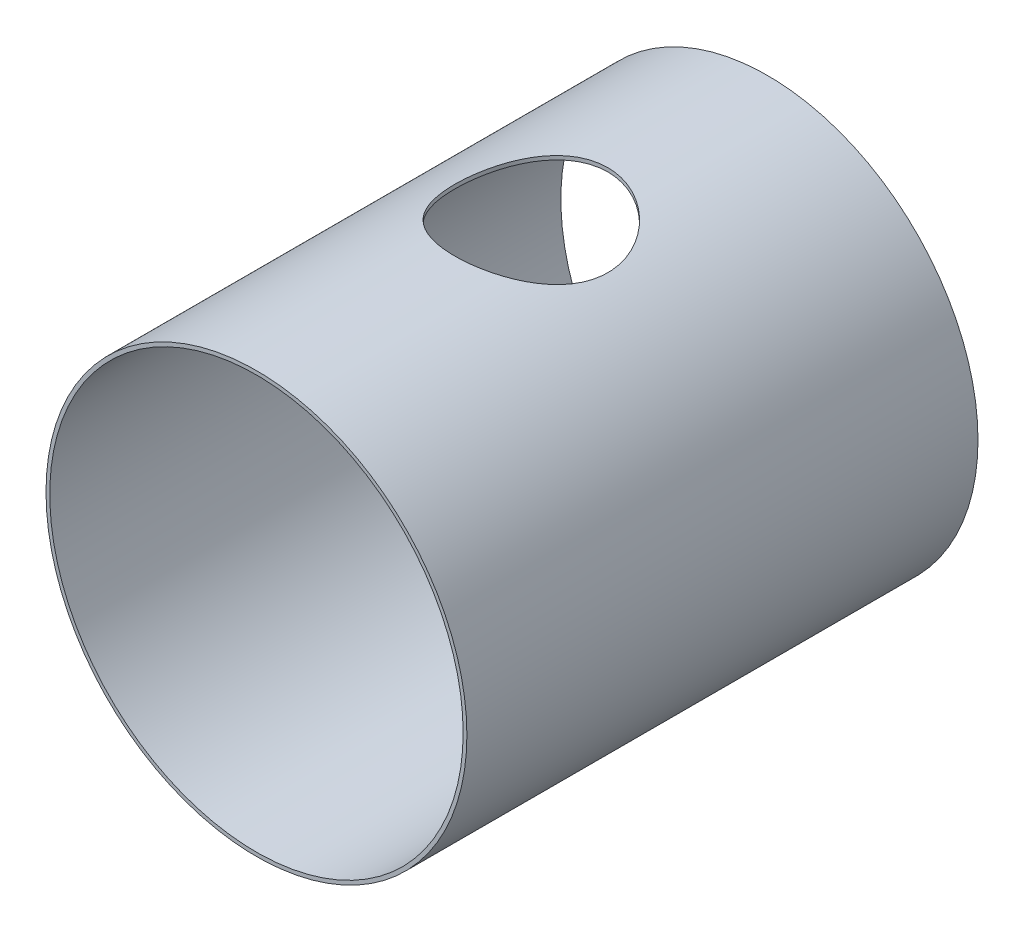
ISO-10303-21;
HEADER;
FILE_DESCRIPTION(('STEP AP214'),'2;1');
FILE_NAME('part.step','',(''),(''),'','','');
FILE_SCHEMA(('AUTOMOTIVE_DESIGN { 1 0 10303 214 1 1 1 1 }'));
ENDSEC;
DATA;
#1=APPLICATION_CONTEXT('core data for automotive mechanical design processes');
#2=APPLICATION_PROTOCOL_DEFINITION('international standard','automotive_design',2000,#1);
#3=PRODUCT_CONTEXT('',#1,'mechanical');
#4=PRODUCT('Part','Part','',(#3));
#5=PRODUCT_RELATED_PRODUCT_CATEGORY('part','',(#4));
#6=PRODUCT_DEFINITION_FORMATION('','',#4);
#7=PRODUCT_DEFINITION_CONTEXT('part definition',#1,'design');
#8=PRODUCT_DEFINITION('design','',#6,#7);
#9=PRODUCT_DEFINITION_SHAPE('','',#8);
#10=(LENGTH_UNIT() NAMED_UNIT(*) SI_UNIT(.MILLI.,.METRE.));
#11=(NAMED_UNIT(*) PLANE_ANGLE_UNIT() SI_UNIT($,.RADIAN.));
#12=(NAMED_UNIT(*) SI_UNIT($,.STERADIAN.) SOLID_ANGLE_UNIT());
#13=UNCERTAINTY_MEASURE_WITH_UNIT(LENGTH_MEASURE(1.E-05),#10,'distance_accuracy_value','');
#14=(GEOMETRIC_REPRESENTATION_CONTEXT(3) GLOBAL_UNCERTAINTY_ASSIGNED_CONTEXT((#13)) GLOBAL_UNIT_ASSIGNED_CONTEXT((#10,
#11,#12)) REPRESENTATION_CONTEXT('',''));
#15=CARTESIAN_POINT('',(0.,0.,0.));
#16=DIRECTION('',(0.,0.,1.));
#17=DIRECTION('',(1.,0.,0.));
#18=AXIS2_PLACEMENT_3D('',#15,#16,#17);
#19=CARTESIAN_POINT('',(0.,0.,1727.2));
#20=DIRECTION('',(0.,0.,-1.));
#21=DIRECTION('',(-1.,0.,0.));
#22=AXIS2_PLACEMENT_3D('',#19,#20,#21);
#23=CYLINDRICAL_SURFACE('',#22,711.2);
#24=CARTESIAN_POINT('',(332.623736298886,-628.623011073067,588.41132));
#25=CARTESIAN_POINT('',(332.623731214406,-628.62301335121,589.148577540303));
#26=CARTESIAN_POINT('',(332.651219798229,-628.60847090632,589.885745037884));
#27=CARTESIAN_POINT('',(332.760967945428,-628.550381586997,591.355082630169));
#28=CARTESIAN_POINT('',(332.843241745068,-628.506827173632,592.087251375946));
#29=CARTESIAN_POINT('',(333.062077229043,-628.390887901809,593.541931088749));
#30=CARTESIAN_POINT('',(333.198698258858,-628.318471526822,594.264430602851));
#31=CARTESIAN_POINT('',(333.525179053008,-628.145229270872,595.693778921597));
#32=CARTESIAN_POINT('',(333.715035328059,-628.044405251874,596.40062874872));
#33=CARTESIAN_POINT('',(334.146452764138,-627.81497888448,597.793366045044));
#34=CARTESIAN_POINT('',(334.387989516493,-627.686389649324,598.479263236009));
#35=CARTESIAN_POINT('',(334.921004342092,-627.402145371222,599.825583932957));
#36=CARTESIAN_POINT('',(335.212483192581,-627.246489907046,600.486007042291));
#37=CARTESIAN_POINT('',(335.843110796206,-626.909062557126,601.776519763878));
#38=CARTESIAN_POINT('',(336.182247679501,-626.727297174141,602.406616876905));
#39=CARTESIAN_POINT('',(336.905706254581,-626.338689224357,603.632183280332));
#40=CARTESIAN_POINT('',(337.290027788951,-626.131846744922,604.227652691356));
#41=CARTESIAN_POINT('',(338.101206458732,-625.694195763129,605.380051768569));
#42=CARTESIAN_POINT('',(338.528086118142,-625.463374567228,605.936960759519));
#43=CARTESIAN_POINT('',(339.421035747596,-624.97924633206,607.007939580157));
#44=CARTESIAN_POINT('',(339.887105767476,-624.7259392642,607.52200935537));
#45=CARTESIAN_POINT('',(340.855001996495,-624.198374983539,608.503679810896));
#46=CARTESIAN_POINT('',(341.356829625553,-623.924116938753,608.971278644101));
#47=CARTESIAN_POINT('',(342.392520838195,-623.356359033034,609.856662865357));
#48=CARTESIAN_POINT('',(342.926384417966,-623.062859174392,610.274448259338));
#49=CARTESIAN_POINT('',(344.022369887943,-622.458384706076,611.057341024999));
#50=CARTESIAN_POINT('',(344.584499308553,-622.147405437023,611.422434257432));
#51=CARTESIAN_POINT('',(345.732766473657,-621.510036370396,612.097210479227));
#52=CARTESIAN_POINT('',(346.318904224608,-621.183646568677,612.406893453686));
#53=CARTESIAN_POINT('',(347.510908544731,-620.517585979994,612.968640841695));
#54=CARTESIAN_POINT('',(348.116775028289,-620.177915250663,613.220705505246));
#55=CARTESIAN_POINT('',(349.343836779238,-619.487545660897,613.665419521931));
#56=CARTESIAN_POINT('',(349.965032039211,-619.136846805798,613.858068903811));
#57=CARTESIAN_POINT('',(351.217969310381,-618.426953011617,614.182502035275));
#58=CARTESIAN_POINT('',(351.849706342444,-618.067762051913,614.314313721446));
#59=CARTESIAN_POINT('',(353.119460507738,-617.343195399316,614.516260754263));
#60=CARTESIAN_POINT('',(353.75747763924,-616.977819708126,614.586396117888));
#61=CARTESIAN_POINT('',(355.035221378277,-616.243437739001,614.664489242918));
#62=CARTESIAN_POINT('',(355.674947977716,-615.874431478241,614.672447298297));
#63=CARTESIAN_POINT('',(356.951557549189,-615.13540748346,614.626129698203));
#64=CARTESIAN_POINT('',(357.588440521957,-614.765389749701,614.571854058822));
#65=CARTESIAN_POINT('',(358.854542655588,-614.027193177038,614.401498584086));
#66=CARTESIAN_POINT('',(359.483765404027,-613.659013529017,614.28544891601));
#67=CARTESIAN_POINT('',(360.730436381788,-612.927006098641,613.992392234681));
#68=CARTESIAN_POINT('',(361.347884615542,-612.563178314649,613.815385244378));
#69=CARTESIAN_POINT('',(362.566689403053,-611.842575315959,613.401675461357));
#70=CARTESIAN_POINT('',(363.168045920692,-611.485800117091,613.164972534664));
#71=CARTESIAN_POINT('',(364.350484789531,-610.781988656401,612.633557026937));
#72=CARTESIAN_POINT('',(364.931567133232,-610.434952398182,612.338844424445));
#73=CARTESIAN_POINT('',(366.069580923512,-609.753181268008,611.693427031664));
#74=CARTESIAN_POINT('',(366.626506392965,-609.418449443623,611.342708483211));
#75=CARTESIAN_POINT('',(367.712224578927,-608.763962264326,610.587824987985));
#76=CARTESIAN_POINT('',(368.241017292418,-608.444206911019,610.183660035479));
#77=CARTESIAN_POINT('',(369.266854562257,-607.822169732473,609.324753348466));
#78=CARTESIAN_POINT('',(369.763899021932,-607.51988796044,608.870011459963));
#79=CARTESIAN_POINT('',(370.722854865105,-606.935186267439,607.913179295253));
#80=CARTESIAN_POINT('',(371.184766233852,-606.652766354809,607.411088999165));
#81=CARTESIAN_POINT('',(372.070589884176,-606.109879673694,606.362808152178));
#82=CARTESIAN_POINT('',(372.494479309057,-605.849426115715,605.816591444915));
#83=CARTESIAN_POINT('',(373.301083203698,-605.352761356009,604.684196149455));
#84=CARTESIAN_POINT('',(373.683797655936,-605.116550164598,604.098017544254));
#85=CARTESIAN_POINT('',(374.405472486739,-604.670292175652,602.889859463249));
#86=CARTESIAN_POINT('',(374.74443284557,-604.460245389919,602.267879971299));
#87=CARTESIAN_POINT('',(375.376320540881,-604.068039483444,600.992536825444));
#88=CARTESIAN_POINT('',(375.669247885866,-603.88588035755,600.339173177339));
#89=CARTESIAN_POINT('',(376.207108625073,-603.550952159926,599.00569175));
#90=CARTESIAN_POINT('',(376.452041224,-603.39818357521,598.325573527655));
#91=CARTESIAN_POINT('',(376.892265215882,-603.123310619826,596.943427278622));
#92=CARTESIAN_POINT('',(377.087556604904,-603.001206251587,596.241399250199));
#93=CARTESIAN_POINT('',(377.427190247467,-602.788682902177,594.820428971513));
#94=CARTESIAN_POINT('',(377.571532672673,-602.698263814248,594.101486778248));
#95=CARTESIAN_POINT('',(377.808303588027,-602.549869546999,592.651802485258));
#96=CARTESIAN_POINT('',(377.900732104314,-602.491894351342,591.921060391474));
#97=CARTESIAN_POINT('',(378.033018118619,-602.408900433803,590.453412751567));
#98=CARTESIAN_POINT('',(378.072906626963,-602.383862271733,589.716511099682));
#99=CARTESIAN_POINT('',(378.099947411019,-602.366889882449,588.241360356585));
#100=CARTESIAN_POINT('',(378.087099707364,-602.374955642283,587.503111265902));
#101=CARTESIAN_POINT('',(378.008753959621,-602.424123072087,586.030518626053));
#102=CARTESIAN_POINT('',(377.943256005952,-602.465224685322,585.296175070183));
#103=CARTESIAN_POINT('',(377.760047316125,-602.580117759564,583.836615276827));
#104=CARTESIAN_POINT('',(377.642336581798,-602.653909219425,583.111399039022));
#105=CARTESIAN_POINT('',(377.355528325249,-602.833537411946,581.675448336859));
#106=CARTESIAN_POINT('',(377.186444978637,-602.939365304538,580.964709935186));
#107=CARTESIAN_POINT('',(376.798009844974,-603.182188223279,579.562556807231));
#108=CARTESIAN_POINT('',(376.578658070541,-603.319183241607,578.8711420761));
#109=CARTESIAN_POINT('',(376.091151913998,-603.623200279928,577.512542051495));
#110=CARTESIAN_POINT('',(375.822997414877,-603.790222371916,576.845356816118));
#111=CARTESIAN_POINT('',(375.239680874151,-604.152910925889,575.539949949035));
#112=CARTESIAN_POINT('',(374.924518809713,-604.348577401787,574.901728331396));
#113=CARTESIAN_POINT('',(374.249141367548,-604.767044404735,573.658481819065));
#114=CARTESIAN_POINT('',(373.888904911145,-604.989857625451,573.053472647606));
#115=CARTESIAN_POINT('',(373.125917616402,-605.460725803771,571.881266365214));
#116=CARTESIAN_POINT('',(372.723166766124,-605.708780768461,571.314069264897));
#117=CARTESIAN_POINT('',(371.877865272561,-606.228124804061,570.22150866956));
#118=CARTESIAN_POINT('',(371.435314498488,-606.499413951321,569.696145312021));
#119=CARTESIAN_POINT('',(370.513408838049,-607.063049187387,568.690981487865));
#120=CARTESIAN_POINT('',(370.034053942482,-607.355395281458,568.211181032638));
#121=CARTESIAN_POINT('',(369.041557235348,-607.958967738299,567.300328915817));
#122=CARTESIAN_POINT('',(368.528399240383,-608.270203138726,566.869300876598));
#123=CARTESIAN_POINT('',(367.472009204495,-608.908977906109,566.059325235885));
#124=CARTESIAN_POINT('',(366.928777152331,-609.23651727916,565.680377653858));
#125=CARTESIAN_POINT('',(365.815970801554,-609.905350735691,564.977260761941));
#126=CARTESIAN_POINT('',(365.246396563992,-610.246644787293,564.653091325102));
#127=CARTESIAN_POINT('',(364.084837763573,-610.94036408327,564.061839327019));
#128=CARTESIAN_POINT('',(363.492853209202,-611.292789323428,563.794756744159));
#129=CARTESIAN_POINT('',(362.29074004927,-612.006003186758,563.319644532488));
#130=CARTESIAN_POINT('',(361.680616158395,-612.366789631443,563.111599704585));
#131=CARTESIAN_POINT('',(360.44633904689,-613.094111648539,562.755955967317));
#132=CARTESIAN_POINT('',(359.822185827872,-613.46064722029,562.608357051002));
#133=CARTESIAN_POINT('',(358.564235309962,-614.196760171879,562.374659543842));
#134=CARTESIAN_POINT('',(357.930438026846,-614.56633754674,562.288560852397));
#135=CARTESIAN_POINT('',(356.657676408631,-615.305845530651,562.178478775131));
#136=CARTESIAN_POINT('',(356.018712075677,-615.675776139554,562.154495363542));
#137=CARTESIAN_POINT('',(354.740537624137,-616.41312039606,562.168810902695));
#138=CARTESIAN_POINT('',(354.101327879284,-616.78053541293,562.207072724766));
#139=CARTESIAN_POINT('',(352.82684245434,-617.510484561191,562.345535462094));
#140=CARTESIAN_POINT('',(352.19156677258,-617.873018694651,562.445736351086));
#141=CARTESIAN_POINT('',(350.929503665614,-618.590697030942,562.707362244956));
#142=CARTESIAN_POINT('',(350.302716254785,-618.945841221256,562.868787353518));
#143=CARTESIAN_POINT('',(349.062146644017,-619.646322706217,563.251710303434));
#144=CARTESIAN_POINT('',(348.448364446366,-619.991659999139,563.473208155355));
#145=CARTESIAN_POINT('',(347.238239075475,-620.670223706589,563.974701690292));
#146=CARTESIAN_POINT('',(346.641896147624,-621.003449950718,564.254698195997));
#147=CARTESIAN_POINT('',(345.470992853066,-621.655597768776,564.87119397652));
#148=CARTESIAN_POINT('',(344.896432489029,-621.974519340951,565.207693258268));
#149=CARTESIAN_POINT('',(343.773307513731,-622.595988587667,565.934789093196));
#150=CARTESIAN_POINT('',(343.22474199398,-622.898536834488,566.325383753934));
#151=CARTESIAN_POINT('',(342.157605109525,-623.485351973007,567.157904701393));
#152=CARTESIAN_POINT('',(341.639033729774,-623.769618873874,567.599830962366));
#153=CARTESIAN_POINT('',(340.635454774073,-624.318231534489,568.532106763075));
#154=CARTESIAN_POINT('',(340.150463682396,-624.582567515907,569.022479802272));
#155=CARTESIAN_POINT('',(339.217906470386,-625.089540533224,570.047990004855));
#156=CARTESIAN_POINT('',(338.770340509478,-625.33217747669,570.583127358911));
#157=CARTESIAN_POINT('',(337.915848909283,-625.794339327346,571.694508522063));
#158=CARTESIAN_POINT('',(337.508933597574,-626.013858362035,572.270762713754));
#159=CARTESIAN_POINT('',(336.738911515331,-626.42839713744,573.460157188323));
#160=CARTESIAN_POINT('',(336.375804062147,-626.623417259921,574.073296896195));
#161=CARTESIAN_POINT('',(335.695863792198,-626.987939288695,575.332568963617));
#162=CARTESIAN_POINT('',(335.37906420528,-627.157422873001,575.978724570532));
#163=CARTESIAN_POINT('',(334.794412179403,-627.469721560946,577.29906882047));
#164=CARTESIAN_POINT('',(334.526562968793,-627.612534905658,577.973259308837));
#165=CARTESIAN_POINT('',(334.04212286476,-627.870508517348,579.344098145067));
#166=CARTESIAN_POINT('',(333.825476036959,-627.985698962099,580.040721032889));
#167=CARTESIAN_POINT('',(333.444753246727,-628.187935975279,581.451932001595));
#168=CARTESIAN_POINT('',(333.280663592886,-628.274989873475,582.166515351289));
#169=CARTESIAN_POINT('',(332.970916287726,-628.439215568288,583.79439800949));
#170=CARTESIAN_POINT('',(332.840843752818,-628.508092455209,584.711553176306));
#171=CARTESIAN_POINT('',(332.667256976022,-628.599988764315,586.55629306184));
#172=CARTESIAN_POINT('',(332.623742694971,-628.623008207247,587.48387777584));
#173=CARTESIAN_POINT('',(332.623736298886,-628.623011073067,588.41132));
#174=B_SPLINE_CURVE_WITH_KNOTS('',3,(#24,#25,#26,#27,#28,#29,#30,#31,#32,#33,#34,#35,#36,#37,
#38,#39,#40,#41,#42,#43,#44,#45,#46,#47,#48,#49,#50,#51,#52,#53,#54,#55,#56,#57,#58,#59,#60,#61,
#62,#63,#64,#65,#66,#67,#68,#69,#70,#71,#72,#73,#74,#75,#76,#77,#78,#79,#80,#81,#82,#83,#84,#85,
#86,#87,#88,#89,#90,#91,#92,#93,#94,#95,#96,#97,#98,#99,#100,#101,#102,#103,#104,#105,#106,#107,
#108,#109,#110,#111,#112,#113,#114,#115,#116,#117,#118,#119,#120,#121,#122,#123,#124,#125,#126,
#127,#128,#129,#130,#131,#132,#133,#134,#135,#136,#137,#138,#139,#140,#141,#142,#143,#144,#145,
#146,#147,#148,#149,#150,#151,#152,#153,#154,#155,#156,#157,#158,#159,#160,#161,#162,#163,#164,
#165,#166,#167,#168,#169,#170,#171,#172,#173),.UNSPECIFIED.,.T.,.F.,(4,2,2,2,2,2,2,2,2,2,2,2,2,
2,2,2,2,2,2,2,2,2,2,2,2,2,2,2,2,2,2,2,2,2,2,2,2,2,2,2,2,2,2,2,2,2,2,2,2,2,2,2,2,2,2,2,2,2,2,2,2,
2,2,2,2,2,2,2,2,2,2,2,2,2,4),(0.,2.21096237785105,4.42249951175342,6.63645823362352,
8.85027187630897,11.0630422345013,13.2758470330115,15.4881016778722,17.7003486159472,
19.9137726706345,22.1271995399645,24.340714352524,26.5542289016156,28.7683363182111,
30.9824443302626,33.1965427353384,35.4106400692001,37.623719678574,39.8367986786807,
42.0498672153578,44.2629351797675,46.4749233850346,48.686910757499,50.8989030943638,
53.1108962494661,55.3234336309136,57.5359712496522,59.7485156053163,61.9610608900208,
64.1749274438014,66.3887949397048,68.6026634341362,70.8165315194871,73.0304362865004,
75.2443412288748,77.4582387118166,79.6721350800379,81.8847241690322,84.097312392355,
86.3098968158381,88.5224811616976,90.7344555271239,92.9464293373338,95.1584084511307,
97.3703886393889,99.5834071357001,101.796426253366,104.009452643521,106.222479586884,
108.436573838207,110.65066891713,112.864758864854,115.078847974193,117.292366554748,
119.505884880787,121.719399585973,123.932913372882,126.145107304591,128.357300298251,
130.569497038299,132.781694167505,134.993922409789,137.206150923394,139.418302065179,
141.63045209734,143.84368046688,146.056918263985,148.270716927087,150.484481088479,
152.699826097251,154.915317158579,157.128376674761,159.340859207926,162.122167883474,
164.903475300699),.UNSPECIFIED.);
#175=CARTESIAN_POINT('',(332.623736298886,-628.623011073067,588.41132));
#176=VERTEX_POINT('',#175);
#177=EDGE_CURVE('E64',#176,#176,#174,.T.);
#178=ORIENTED_EDGE('',*,*,#177,.T.);
#179=EDGE_LOOP('',(#178));
#180=FACE_BOUND('',#179,.T.);
#181=CARTESIAN_POINT('',(0.,0.,0.));
#182=DIRECTION('',(0.,0.,1.));
#183=DIRECTION('',(1.,0.,0.));
#184=AXIS2_PLACEMENT_3D('',#181,#182,#183);
#185=CIRCLE('',#184,711.2);
#186=CARTESIAN_POINT('',(711.2,0.,0.));
#187=VERTEX_POINT('',#186);
#188=EDGE_CURVE('E47',#187,#187,#185,.T.);
#189=ORIENTED_EDGE('',*,*,#188,.T.);
#190=EDGE_LOOP('',(#189));
#191=FACE_BOUND('',#190,.T.);
#192=CARTESIAN_POINT('',(0.,0.,1727.2));
#193=DIRECTION('',(0.,0.,1.));
#194=DIRECTION('',(1.,0.,0.));
#195=AXIS2_PLACEMENT_3D('',#192,#193,#194);
#196=CIRCLE('',#195,711.2);
#197=CARTESIAN_POINT('',(711.2,0.,1727.2));
#198=VERTEX_POINT('',#197);
#199=EDGE_CURVE('E10',#198,#198,#196,.T.);
#200=ORIENTED_EDGE('',*,*,#199,.F.);
#201=EDGE_LOOP('',(#200));
#202=FACE_BOUND('',#201,.T.);
#203=CARTESIAN_POINT('',(0.,711.2,539.65094));
#204=CARTESIAN_POINT('',(-3.5105697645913,711.200001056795,539.650938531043));
#205=CARTESIAN_POINT('',(-7.02109736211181,711.17399290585,539.722394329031));
#206=CARTESIAN_POINT('',(-14.0355323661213,711.070141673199,540.008030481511));
#207=CARTESIAN_POINT('',(-17.5394398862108,710.992299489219,540.222208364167));
#208=CARTESIAN_POINT('',(-24.5339216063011,710.785317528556,540.792731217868));
#209=CARTESIAN_POINT('',(-28.0244965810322,710.656180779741,541.149067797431));
#210=CARTESIAN_POINT('',(-34.9860910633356,710.347487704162,542.003020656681));
#211=CARTESIAN_POINT('',(-38.4571104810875,710.167931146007,542.500637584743));
#212=CARTESIAN_POINT('',(-45.3729176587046,709.759632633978,543.635874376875));
#213=CARTESIAN_POINT('',(-48.817707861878,709.530895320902,544.273481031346));
#214=CARTESIAN_POINT('',(-55.6752115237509,709.025761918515,545.687188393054));
#215=CARTESIAN_POINT('',(-59.0879250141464,708.749365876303,546.463288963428));
#216=CARTESIAN_POINT('',(-65.8753448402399,708.150750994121,548.152174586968));
#217=CARTESIAN_POINT('',(-69.2500505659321,707.828531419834,549.064961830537));
#218=CARTESIAN_POINT('',(-75.9556208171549,707.140398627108,551.02512808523));
#219=CARTESIAN_POINT('',(-79.286485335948,706.774485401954,552.072507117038));
#220=CARTESIAN_POINT('',(-85.8924697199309,706.002097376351,554.297403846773));
#221=CARTESIAN_POINT('',(-89.1676843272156,705.59570179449,555.474667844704));
#222=CARTESIAN_POINT('',(-95.6636192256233,704.744381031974,557.958464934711));
#223=CARTESIAN_POINT('',(-98.8843395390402,704.299455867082,559.2649979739));
#224=CARTESIAN_POINT('',(-105.266197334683,703.373914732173,562.004646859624));
#225=CARTESIAN_POINT('',(-108.427335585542,702.893299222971,563.437761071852));
#226=CARTESIAN_POINT('',(-114.685263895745,701.899400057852,566.427778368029));
#227=CARTESIAN_POINT('',(-117.782053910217,701.386116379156,567.984681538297));
#228=CARTESIAN_POINT('',(-123.907276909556,700.329984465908,571.219654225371));
#229=CARTESIAN_POINT('',(-126.935697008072,699.787130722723,572.897746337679));
#230=CARTESIAN_POINT('',(-132.919215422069,698.675305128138,576.371818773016));
#231=CARTESIAN_POINT('',(-135.874313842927,698.106333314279,578.167798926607));
#232=CARTESIAN_POINT('',(-141.706979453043,696.945775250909,581.874521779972));
#233=CARTESIAN_POINT('',(-144.584548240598,696.354189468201,583.785262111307));
#234=CARTESIAN_POINT('',(-150.258502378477,695.151949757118,587.718562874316));
#235=CARTESIAN_POINT('',(-153.054880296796,694.541294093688,589.741133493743));
#236=CARTESIAN_POINT('',(-158.662429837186,693.282213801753,593.970193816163));
#237=CARTESIAN_POINT('',(-161.470449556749,692.63322295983,596.180695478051));
#238=CARTESIAN_POINT('',(-166.990895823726,691.323028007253,600.714602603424));
#239=CARTESIAN_POINT('',(-169.70332130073,690.661823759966,603.038009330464));
#240=CARTESIAN_POINT('',(-175.028681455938,689.331511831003,607.79408845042));
#241=CARTESIAN_POINT('',(-177.641614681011,688.662404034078,610.226762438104));
#242=CARTESIAN_POINT('',(-182.764153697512,687.32067802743,615.19763003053));
#243=CARTESIAN_POINT('',(-185.273759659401,686.648059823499,617.735823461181));
#244=CARTESIAN_POINT('',(-190.186621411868,685.303565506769,622.914656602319));
#245=CARTESIAN_POINT('',(-192.589848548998,684.631689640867,625.555323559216));
#246=CARTESIAN_POINT('',(-197.28561647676,683.293338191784,630.934594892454));
#247=CARTESIAN_POINT('',(-199.578157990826,682.62686257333,633.673198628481));
#248=CARTESIAN_POINT('',(-204.049185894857,681.303754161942,639.244600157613));
#249=CARTESIAN_POINT('',(-206.227664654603,680.647122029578,642.077404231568));
#250=CARTESIAN_POINT('',(-210.466732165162,679.348296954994,647.83270319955));
#251=CARTESIAN_POINT('',(-212.527331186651,678.706102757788,650.755190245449));
#252=CARTESIAN_POINT('',(-216.598566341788,677.41805440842,656.791365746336));
#253=CARTESIAN_POINT('',(-218.604819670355,676.77288227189,659.908157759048));
#254=CARTESIAN_POINT('',(-222.483713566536,675.507660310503,666.228804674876));
#255=CARTESIAN_POINT('',(-224.356353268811,674.887610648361,669.432660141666));
#256=CARTESIAN_POINT('',(-227.96439877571,673.677440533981,675.922426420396));
#257=CARTESIAN_POINT('',(-229.699799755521,673.087321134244,679.208340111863));
#258=CARTESIAN_POINT('',(-233.029696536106,671.941739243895,685.856724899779));
#259=CARTESIAN_POINT('',(-234.624192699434,671.386276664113,689.219195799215));
#260=CARTESIAN_POINT('',(-237.668371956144,670.314693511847,696.014066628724));
#261=CARTESIAN_POINT('',(-239.118095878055,669.798561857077,699.446446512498));
#262=CARTESIAN_POINT('',(-241.869908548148,668.809782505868,706.376074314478));
#263=CARTESIAN_POINT('',(-243.171996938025,668.337134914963,709.873322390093));
#264=CARTESIAN_POINT('',(-245.62532522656,667.439394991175,716.926196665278));
#265=CARTESIAN_POINT('',(-246.776571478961,667.014300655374,720.481820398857));
#266=CARTESIAN_POINT('',(-248.925342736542,666.215376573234,727.644898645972));
#267=CARTESIAN_POINT('',(-249.922869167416,665.841546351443,731.252352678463));
#268=CARTESIAN_POINT('',(-251.725654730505,665.162029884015,738.370339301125));
#269=CARTESIAN_POINT('',(-252.536899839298,664.854252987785,741.879157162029));
#270=CARTESIAN_POINT('',(-254.012923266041,664.291727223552,748.931675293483));
#271=CARTESIAN_POINT('',(-254.67770273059,664.036977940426,752.475375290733));
#272=CARTESIAN_POINT('',(-255.85903399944,663.582696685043,759.59086482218));
#273=CARTESIAN_POINT('',(-256.375588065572,663.383163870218,763.162653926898));
#274=CARTESIAN_POINT('',(-257.259081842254,663.041046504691,770.327416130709));
#275=CARTESIAN_POINT('',(-257.626021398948,662.898462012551,773.920389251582));
#276=CARTESIAN_POINT('',(-258.209172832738,662.671533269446,781.119195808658));
#277=CARTESIAN_POINT('',(-258.425434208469,662.5871698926,784.725024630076));
#278=CARTESIAN_POINT('',(-258.706817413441,662.477354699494,791.943483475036));
#279=CARTESIAN_POINT('',(-258.771938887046,662.451903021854,795.556113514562));
#280=CARTESIAN_POINT('',(-258.750858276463,662.460137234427,802.780746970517));
#281=CARTESIAN_POINT('',(-258.6646609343,662.493821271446,806.392750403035));
#282=CARTESIAN_POINT('',(-258.341194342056,662.620025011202,813.608927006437));
#283=CARTESIAN_POINT('',(-258.103926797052,662.712544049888,817.213100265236));
#284=CARTESIAN_POINT('',(-257.496467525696,662.948797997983,824.205255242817));
#285=CARTESIAN_POINT('',(-257.134449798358,663.089380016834,827.59405722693));
#286=CARTESIAN_POINT('',(-256.277261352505,663.42114570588,834.352255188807));
#287=CARTESIAN_POINT('',(-255.782092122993,663.612328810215,837.721651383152));
#288=CARTESIAN_POINT('',(-254.65981896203,664.043807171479,844.435065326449));
#289=CARTESIAN_POINT('',(-254.032720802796,664.284100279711,847.779084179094));
#290=CARTESIAN_POINT('',(-252.648049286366,664.811967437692,854.436233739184));
#291=CARTESIAN_POINT('',(-251.890475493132,665.09954164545,857.749364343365));
#292=CARTESIAN_POINT('',(-250.246506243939,665.719834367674,864.339549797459));
#293=CARTESIAN_POINT('',(-249.36009897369,666.052557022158,867.616601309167));
#294=CARTESIAN_POINT('',(-247.460466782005,666.760665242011,874.129052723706));
#295=CARTESIAN_POINT('',(-246.447242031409,667.136050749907,877.364452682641));
#296=CARTESIAN_POINT('',(-244.296091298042,667.926772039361,883.788646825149));
#297=CARTESIAN_POINT('',(-243.158162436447,668.342108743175,886.977439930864));
#298=CARTESIAN_POINT('',(-240.759925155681,669.209776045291,893.303549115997));
#299=CARTESIAN_POINT('',(-239.499616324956,669.662106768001,896.44086502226));
#300=CARTESIAN_POINT('',(-236.835087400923,670.609138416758,902.715892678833));
#301=CARTESIAN_POINT('',(-235.428670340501,671.104459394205,905.852577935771));
#302=CARTESIAN_POINT('',(-232.494185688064,672.126704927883,912.063257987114));
#303=CARTESIAN_POINT('',(-230.966117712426,672.653629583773,915.13725258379));
#304=CARTESIAN_POINT('',(-227.791182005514,673.735430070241,921.218050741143));
#305=CARTESIAN_POINT('',(-226.144319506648,674.290304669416,924.224857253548));
#306=CARTESIAN_POINT('',(-222.734446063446,675.424336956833,930.167508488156));
#307=CARTESIAN_POINT('',(-220.971425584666,676.003496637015,933.103347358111));
#308=CARTESIAN_POINT('',(-217.331859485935,677.18237023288,938.900486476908));
#309=CARTESIAN_POINT('',(-215.45528863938,677.782088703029,941.761769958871));
#310=CARTESIAN_POINT('',(-211.591929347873,678.99808273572,947.405321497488));
#311=CARTESIAN_POINT('',(-209.605140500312,679.614358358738,950.187589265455));
#312=CARTESIAN_POINT('',(-205.52421616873,680.859594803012,955.669617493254));
#313=CARTESIAN_POINT('',(-203.430073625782,681.48855645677,958.369372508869));
#314=CARTESIAN_POINT('',(-199.13775536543,682.755154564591,963.682458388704));
#315=CARTESIAN_POINT('',(-196.939586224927,683.392790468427,966.295794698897));
#316=CARTESIAN_POINT('',(-192.300307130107,684.713231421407,971.594829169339));
#317=CARTESIAN_POINT('',(-189.85261902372,685.396348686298,974.274694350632));
#318=CARTESIAN_POINT('',(-184.846791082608,686.763303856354,979.529044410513));
#319=CARTESIAN_POINT('',(-182.288650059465,687.447141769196,982.103528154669));
#320=CARTESIAN_POINT('',(-177.065706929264,688.810903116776,987.143238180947));
#321=CARTESIAN_POINT('',(-174.400900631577,689.490826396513,989.608460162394));
#322=CARTESIAN_POINT('',(-168.968731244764,690.842124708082,994.425627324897));
#323=CARTESIAN_POINT('',(-166.201368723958,691.513499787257,996.777573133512));
#324=CARTESIAN_POINT('',(-160.567771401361,692.843278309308,1001.36471236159));
#325=CARTESIAN_POINT('',(-157.70152167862,693.501679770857,1003.59988803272));
#326=CARTESIAN_POINT('',(-151.874836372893,694.800966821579,1007.94931372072));
#327=CARTESIAN_POINT('',(-148.914400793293,695.44185241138,1010.06356374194));
#328=CARTESIAN_POINT('',(-142.903825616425,696.701776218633,1014.1673971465));
#329=CARTESIAN_POINT('',(-139.853686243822,697.320814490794,1016.15698084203));
#330=CARTESIAN_POINT('',(-133.668382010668,698.532844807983,1020.00781443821));
#331=CARTESIAN_POINT('',(-130.533216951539,699.125836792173,1021.8690640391));
#332=CARTESIAN_POINT('',(-124.138709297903,700.289745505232,1025.48455008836));
#333=CARTESIAN_POINT('',(-120.878247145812,700.860241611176,1027.23694271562));
#334=CARTESIAN_POINT('',(-114.280388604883,701.966253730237,1030.60245518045));
#335=CARTESIAN_POINT('',(-110.942992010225,702.501769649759,1032.21557464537));
#336=CARTESIAN_POINT('',(-104.196888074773,703.534002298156,1035.29905495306));
#337=CARTESIAN_POINT('',(-100.788179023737,704.030718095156,1036.76941236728));
#338=CARTESIAN_POINT('',(-93.9055408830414,704.981742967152,1039.56396503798));
#339=CARTESIAN_POINT('',(-90.4316119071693,705.436052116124,1040.88816054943));
#340=CARTESIAN_POINT('',(-83.4260072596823,706.298798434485,1043.38682323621));
#341=CARTESIAN_POINT('',(-79.8943510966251,706.707250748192,1044.56133986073));
#342=CARTESIAN_POINT('',(-72.7787799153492,707.47543726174,1046.75825059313));
#343=CARTESIAN_POINT('',(-69.194864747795,707.835171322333,1047.7806442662));
#344=CARTESIAN_POINT('',(-61.9818719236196,708.503214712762,1049.67063524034));
#345=CARTESIAN_POINT('',(-58.3527963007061,708.81152634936,1050.53823948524));
#346=CARTESIAN_POINT('',(-51.0565431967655,709.374412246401,1052.1163997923));
#347=CARTESIAN_POINT('',(-47.3893661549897,709.628987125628,1052.82695766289));
#348=CARTESIAN_POINT('',(-40.2104431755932,710.07100515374,1054.05720796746));
#349=CARTESIAN_POINT('',(-36.7002055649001,710.26119026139,1054.58472998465));
#350=CARTESIAN_POINT('',(-29.6586394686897,710.590055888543,1055.49513764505));
#351=CARTESIAN_POINT('',(-26.1273111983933,710.728736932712,1055.87802476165));
#352=CARTESIAN_POINT('',(-19.0503222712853,710.953626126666,1056.49818077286));
#353=CARTESIAN_POINT('',(-15.5046620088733,711.039835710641,1056.73545364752));
#354=CARTESIAN_POINT('',(-8.40567514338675,711.159185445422,1057.06378673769));
#355=CARTESIAN_POINT('',(-4.85234852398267,711.192325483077,1057.15484664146));
#356=CARTESIAN_POINT('',(2.25448405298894,711.205302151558,1057.19051295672));
#357=CARTESIAN_POINT('',(5.80798985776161,711.185148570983,1057.13514626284));
#358=CARTESIAN_POINT('',(12.9090115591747,711.091699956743,1056.87815997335));
#359=CARTESIAN_POINT('',(16.456527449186,711.018404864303,1056.67654021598));
#360=CARTESIAN_POINT('',(23.5387290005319,710.819187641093,1056.12757289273));
#361=CARTESIAN_POINT('',(27.0734148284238,710.693266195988,1055.7802272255));
#362=CARTESIAN_POINT('',(34.1232879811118,710.389674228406,1054.94069748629));
#363=CARTESIAN_POINT('',(37.6384754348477,710.212004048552,1054.44851437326));
#364=CARTESIAN_POINT('',(44.5173479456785,709.81341699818,1053.34075408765));
#365=CARTESIAN_POINT('',(47.881950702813,709.594276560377,1052.73022661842));
#366=CARTESIAN_POINT('',(54.5811606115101,709.110439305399,1051.37708513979));
#367=CARTESIAN_POINT('',(57.9157679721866,708.845742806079,1050.63447205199));
#368=CARTESIAN_POINT('',(64.5493033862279,708.272483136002,1049.01885108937));
#369=CARTESIAN_POINT('',(67.8482326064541,707.963921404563,1048.14584749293));
#370=CARTESIAN_POINT('',(74.405133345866,707.304865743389,1046.27133134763));
#371=CARTESIAN_POINT('',(77.6631047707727,706.954371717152,1045.26981850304));
#372=CARTESIAN_POINT('',(84.1331368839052,706.213607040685,1043.14032180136));
#373=CARTESIAN_POINT('',(87.3451939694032,705.823333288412,1042.01232808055));
#374=CARTESIAN_POINT('',(93.7181473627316,705.005439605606,1039.63224141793));
#375=CARTESIAN_POINT('',(96.8790437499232,704.577819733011,1038.38014866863));
#376=CARTESIAN_POINT('',(103.144990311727,703.68783198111,1035.75429613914));
#377=CARTESIAN_POINT('',(106.250039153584,703.225463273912,1034.38053346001));
#378=CARTESIAN_POINT('',(112.399672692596,702.268778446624,1031.51396334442));
#379=CARTESIAN_POINT('',(115.444257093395,701.774462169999,1030.02115532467));
#380=CARTESIAN_POINT('',(121.554944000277,700.742256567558,1026.87475615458));
#381=CARTESIAN_POINT('',(124.619163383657,700.203524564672,1025.2177836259));
#382=CARTESIAN_POINT('',(130.674537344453,699.098760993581,1021.78378690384));
#383=CARTESIAN_POINT('',(133.665691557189,698.532729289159,1020.00676211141));
#384=CARTESIAN_POINT('',(139.570542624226,697.376909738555,1016.3358581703));
#385=CARTESIAN_POINT('',(142.48424221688,696.787122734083,1014.44198316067));
#386=CARTESIAN_POINT('',(148.230448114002,695.58737029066,1010.54035277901));
#387=CARTESIAN_POINT('',(151.062947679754,694.977403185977,1008.53258799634));
#388=CARTESIAN_POINT('',(156.64330639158,693.740934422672,1004.40604001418));
#389=CARTESIAN_POINT('',(159.391143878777,693.114428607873,1002.28722877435));
#390=CARTESIAN_POINT('',(164.797683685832,691.848879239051,997.942340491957));
#391=CARTESIAN_POINT('',(167.456385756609,691.209835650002,995.716263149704));
#392=CARTESIAN_POINT('',(172.681199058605,689.923099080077,991.160035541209));
#393=CARTESIAN_POINT('',(175.247304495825,689.275405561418,988.82987878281));
#394=CARTESIAN_POINT('',(180.283075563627,687.975446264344,984.069167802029));
#395=CARTESIAN_POINT('',(182.752747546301,687.323180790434,981.638620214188));
#396=CARTESIAN_POINT('',(187.724705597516,685.98240627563,976.544895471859));
#397=CARTESIAN_POINT('',(190.221398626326,685.293864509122,973.876264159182));
#398=CARTESIAN_POINT('',(195.100059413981,683.920922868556,968.435057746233));
#399=CARTESIAN_POINT('',(197.48202608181,683.23652303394,965.662481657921));
#400=CARTESIAN_POINT('',(202.127499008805,681.876654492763,960.017485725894));
#401=CARTESIAN_POINT('',(204.391000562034,681.201186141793,957.145061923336));
#402=CARTESIAN_POINT('',(208.795675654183,679.864032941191,951.304821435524));
#403=CARTESIAN_POINT('',(210.936850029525,679.202347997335,948.337005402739));
#404=CARTESIAN_POINT('',(215.093403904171,677.897494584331,942.310139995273));
#405=CARTESIAN_POINT('',(217.108770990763,677.254327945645,939.251081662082));
#406=CARTESIAN_POINT('',(221.009848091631,675.991339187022,933.046670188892));
#407=CARTESIAN_POINT('',(222.895558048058,675.371517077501,929.901317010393));
#408=CARTESIAN_POINT('',(226.533732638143,674.15991000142,923.529222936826));
#409=CARTESIAN_POINT('',(228.286198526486,673.568124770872,920.302482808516));
#410=CARTESIAN_POINT('',(231.654410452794,672.417163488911,913.772709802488));
#411=CARTESIAN_POINT('',(233.270156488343,671.857987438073,910.469676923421));
#412=CARTESIAN_POINT('',(236.364973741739,670.775471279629,903.785283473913));
#413=CARTESIAN_POINT('',(237.84373273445,670.25221370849,900.40376492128));
#414=CARTESIAN_POINT('',(240.657217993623,669.247170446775,893.575253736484));
#415=CARTESIAN_POINT('',(241.991944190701,668.765384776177,890.128261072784));
#416=CARTESIAN_POINT('',(244.514254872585,667.847303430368,883.174804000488));
#417=CARTESIAN_POINT('',(245.701836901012,667.411008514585,879.668338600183));
#418=CARTESIAN_POINT('',(247.926906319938,666.587651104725,872.602388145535));
#419=CARTESIAN_POINT('',(248.964393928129,666.200588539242,869.042903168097));
#420=CARTESIAN_POINT('',(250.886149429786,665.479250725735,861.879315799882));
#421=CARTESIAN_POINT('',(251.770489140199,665.144950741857,858.275235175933));
#422=CARTESIAN_POINT('',(253.384173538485,664.531899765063,851.027830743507));
#423=CARTESIAN_POINT('',(254.113517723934,664.25314895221,847.384506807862));
#424=CARTESIAN_POINT('',(255.415144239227,663.753742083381,840.066146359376));
#425=CARTESIAN_POINT('',(255.987434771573,663.533082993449,836.391111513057));
#426=CARTESIAN_POINT('',(256.973358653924,663.151877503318,829.016742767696));
#427=CARTESIAN_POINT('',(257.386994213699,662.991330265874,825.31740920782));
#428=CARTESIAN_POINT('',(258.034115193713,662.739728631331,818.127672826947));
#429=CARTESIAN_POINT('',(258.277024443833,662.645042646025,814.638241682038));
#430=CARTESIAN_POINT('',(258.621200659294,662.510791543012,807.65136618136));
#431=CARTESIAN_POINT('',(258.722469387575,662.471225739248,804.15392192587));
#432=CARTESIAN_POINT('',(258.783097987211,662.447544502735,797.157750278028));
#433=CARTESIAN_POINT('',(258.742463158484,662.463426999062,793.659022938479));
#434=CARTESIAN_POINT('',(258.519404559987,662.550505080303,786.66677135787));
#435=CARTESIAN_POINT('',(258.336980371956,662.621700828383,783.17324713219));
#436=CARTESIAN_POINT('',(257.830845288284,662.818805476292,776.198307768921));
#437=CARTESIAN_POINT('',(257.507146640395,662.944709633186,772.716891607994));
#438=CARTESIAN_POINT('',(256.719308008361,663.250190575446,765.772359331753));
#439=CARTESIAN_POINT('',(256.25516794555,663.429767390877,762.309243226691));
#440=CARTESIAN_POINT('',(255.187635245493,663.841123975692,755.407683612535));
#441=CARTESIAN_POINT('',(254.584242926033,664.072903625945,751.969240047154));
#442=CARTESIAN_POINT('',(253.239711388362,664.586793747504,745.123207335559));
#443=CARTESIAN_POINT('',(252.498572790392,664.868903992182,741.715618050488));
#444=CARTESIAN_POINT('',(250.9022955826,665.472904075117,735.029205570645));
#445=CARTESIAN_POINT('',(250.050794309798,665.793507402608,731.749396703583));
#446=CARTESIAN_POINT('',(248.22100355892,666.477852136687,725.22991959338));
#447=CARTESIAN_POINT('',(247.242714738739,666.841593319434,721.990251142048));
#448=CARTESIAN_POINT('',(245.161460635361,667.609562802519,715.556204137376));
#449=CARTESIAN_POINT('',(244.05849913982,668.013789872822,712.361824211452));
#450=CARTESIAN_POINT('',(241.730122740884,668.859867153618,706.023075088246));
#451=CARTESIAN_POINT('',(240.50470757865,669.301717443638,702.878705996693));
#452=CARTESIAN_POINT('',(237.933586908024,670.220047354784,696.644033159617));
#453=CARTESIAN_POINT('',(236.587860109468,670.696533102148,693.55373909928));
#454=CARTESIAN_POINT('',(233.778808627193,671.6808195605,687.432174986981));
#455=CARTESIAN_POINT('',(232.315484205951,672.188620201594,684.400904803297));
#456=CARTESIAN_POINT('',(229.27377978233,673.232173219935,678.401452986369));
#457=CARTESIAN_POINT('',(227.69539623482,673.767926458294,675.433273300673));
#458=CARTESIAN_POINT('',(224.426264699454,674.863885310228,669.56404263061));
#459=CARTESIAN_POINT('',(222.735515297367,675.424091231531,666.662992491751));
#460=CARTESIAN_POINT('',(219.156847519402,676.593995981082,660.788139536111));
#461=CARTESIAN_POINT('',(217.263293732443,677.204768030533,657.817981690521));
#462=CARTESIAN_POINT('',(213.358481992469,678.445130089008,651.960101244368));
#463=CARTESIAN_POINT('',(211.34722303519,679.074720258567,649.072379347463));
#464=CARTESIAN_POINT('',(207.210305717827,680.348449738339,643.383475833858));
#465=CARTESIAN_POINT('',(205.084649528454,680.99258877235,640.582292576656));
#466=CARTESIAN_POINT('',(200.722044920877,682.291199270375,635.070098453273));
#467=CARTESIAN_POINT('',(198.4850880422,682.945671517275,632.359094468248));
#468=CARTESIAN_POINT('',(193.902862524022,684.26077092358,627.03064786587));
#469=CARTESIAN_POINT('',(191.557569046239,684.921399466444,624.413226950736));
#470=CARTESIAN_POINT('',(186.76257372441,686.244392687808,619.276292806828));
#471=CARTESIAN_POINT('',(184.312871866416,686.90675736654,616.756779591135));
#472=CARTESIAN_POINT('',(179.312393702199,688.229027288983,611.819110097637));
#473=CARTESIAN_POINT('',(176.761610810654,688.888932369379,609.400960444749));
#474=CARTESIAN_POINT('',(171.562923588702,690.201992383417,604.669934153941));
#475=CARTESIAN_POINT('',(168.915026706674,690.855147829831,602.357049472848));
#476=CARTESIAN_POINT('',(163.391225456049,692.182933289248,597.727204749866));
#477=CARTESIAN_POINT('',(160.510535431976,692.857010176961,595.415791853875));
#478=CARTESIAN_POINT('',(154.650401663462,694.188534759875,590.916618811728));
#479=CARTESIAN_POINT('',(151.670957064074,694.845982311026,588.728859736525));
#480=CARTESIAN_POINT('',(145.617866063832,696.139681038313,584.48088030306));
#481=CARTESIAN_POINT('',(142.544216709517,696.775931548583,582.420663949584));
#482=CARTESIAN_POINT('',(136.307669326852,698.022758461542,578.43173138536));
#483=CARTESIAN_POINT('',(133.144771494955,698.633334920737,576.50301488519));
#484=CARTESIAN_POINT('',(126.734726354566,699.824532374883,572.780825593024));
#485=CARTESIAN_POINT('',(123.487576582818,700.40515249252,570.987356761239));
#486=CARTESIAN_POINT('',(116.914491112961,701.532294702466,567.539434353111));
#487=CARTESIAN_POINT('',(113.588555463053,702.078816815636,565.884980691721));
#488=CARTESIAN_POINT('',(106.863549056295,703.133846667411,562.718667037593));
#489=CARTESIAN_POINT('',(103.46447810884,703.642354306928,561.206807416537));
#490=CARTESIAN_POINT('',(96.5991735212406,704.617669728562,558.329112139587));
#491=CARTESIAN_POINT('',(93.1329396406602,705.084477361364,556.96327700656));
#492=CARTESIAN_POINT('',(86.0741312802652,705.981286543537,554.356696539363));
#493=CARTESIAN_POINT('',(82.4804063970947,706.410435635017,553.118771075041));
#494=CARTESIAN_POINT('',(75.2367521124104,707.21860266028,550.800994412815));
#495=CARTESIAN_POINT('',(71.58682248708,707.597620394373,549.721143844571));
#496=CARTESIAN_POINT('',(64.2379541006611,708.302584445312,547.722360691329));
#497=CARTESIAN_POINT('',(60.5390137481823,708.62852903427,546.803433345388));
#498=CARTESIAN_POINT('',(53.0998674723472,709.224765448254,545.129071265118));
#499=CARTESIAN_POINT('',(49.3596616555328,709.495057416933,544.373636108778));
#500=CARTESIAN_POINT('',(41.8472055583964,709.977755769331,543.028634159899));
#501=CARTESIAN_POINT('',(38.0749671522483,710.190182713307,542.439008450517));
#502=CARTESIAN_POINT('',(30.5052316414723,710.555577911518,541.426974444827));
#503=CARTESIAN_POINT('',(26.7077344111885,710.708545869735,541.004566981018));
#504=CARTESIAN_POINT('',(19.0960807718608,710.953780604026,540.328243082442));
#505=CARTESIAN_POINT('',(15.2819255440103,711.046051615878,540.074314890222));
#506=CARTESIAN_POINT('',(7.64516343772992,711.169160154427,539.735665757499));
#507=CARTESIAN_POINT('',(3.82255672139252,711.199998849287,539.650941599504));
#508=CARTESIAN_POINT('',(0.,711.2,539.65094));
#509=B_SPLINE_CURVE_WITH_KNOTS('',3,(#203,#204,#205,#206,#207,#208,#209,#210,#211,#212,#213,
#214,#215,#216,#217,#218,#219,#220,#221,#222,#223,#224,#225,#226,#227,#228,#229,#230,#231,#232,
#233,#234,#235,#236,#237,#238,#239,#240,#241,#242,#243,#244,#245,#246,#247,#248,#249,#250,#251,
#252,#253,#254,#255,#256,#257,#258,#259,#260,#261,#262,#263,#264,#265,#266,#267,#268,#269,#270,
#271,#272,#273,#274,#275,#276,#277,#278,#279,#280,#281,#282,#283,#284,#285,#286,#287,#288,#289,
#290,#291,#292,#293,#294,#295,#296,#297,#298,#299,#300,#301,#302,#303,#304,#305,#306,#307,#308,
#309,#310,#311,#312,#313,#314,#315,#316,#317,#318,#319,#320,#321,#322,#323,#324,#325,#326,#327,
#328,#329,#330,#331,#332,#333,#334,#335,#336,#337,#338,#339,#340,#341,#342,#343,#344,#345,#346,
#347,#348,#349,#350,#351,#352,#353,#354,#355,#356,#357,#358,#359,#360,#361,#362,#363,#364,#365,
#366,#367,#368,#369,#370,#371,#372,#373,#374,#375,#376,#377,#378,#379,#380,#381,#382,#383,#384,
#385,#386,#387,#388,#389,#390,#391,#392,#393,#394,#395,#396,#397,#398,#399,#400,#401,#402,#403,
#404,#405,#406,#407,#408,#409,#410,#411,#412,#413,#414,#415,#416,#417,#418,#419,#420,#421,#422,
#423,#424,#425,#426,#427,#428,#429,#430,#431,#432,#433,#434,#435,#436,#437,#438,#439,#440,#441,
#442,#443,#444,#445,#446,#447,#448,#449,#450,#451,#452,#453,#454,#455,#456,#457,#458,#459,#460,
#461,#462,#463,#464,#465,#466,#467,#468,#469,#470,#471,#472,#473,#474,#475,#476,#477,#478,#479,
#480,#481,#482,#483,#484,#485,#486,#487,#488,#489,#490,#491,#492,#493,#494,#495,#496,#497,#498,
#499,#500,#501,#502,#503,#504,#505,#506,#507,#508),.UNSPECIFIED.,.T.,.F.,(4,2,2,2,2,2,2,2,2,2,2,
2,2,2,2,2,2,2,2,2,2,2,2,2,2,2,2,2,2,2,2,2,2,2,2,2,2,2,2,2,2,2,2,2,2,2,2,2,2,2,2,2,2,2,2,2,2,2,2,
2,2,2,2,2,2,2,2,2,2,2,2,2,2,2,2,2,2,2,2,2,2,2,2,2,2,2,2,2,2,2,2,2,2,2,2,2,2,2,2,2,2,2,2,2,2,2,2,
2,2,2,2,2,2,2,2,2,2,2,2,2,2,2,2,2,2,2,2,2,2,2,2,2,2,2,2,2,2,2,2,2,2,2,2,2,2,2,2,2,2,2,2,2,4),
(0.,10.5308138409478,21.0614453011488,31.5914552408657,42.121513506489,52.6505785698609,
63.1796332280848,73.7088566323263,84.2380816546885,94.7470927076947,105.256099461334,
115.764970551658,126.273848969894,136.784691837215,147.295519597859,157.806130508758,
168.317700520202,179.211072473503,190.104566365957,200.998219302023,211.891854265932,
222.788405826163,233.684886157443,244.58209447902,255.478351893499,266.762106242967,
278.045933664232,289.330157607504,300.6143525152,311.895356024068,323.176386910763,
334.456942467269,345.737393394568,356.577434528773,367.417390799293,378.257181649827,
389.09698364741,399.93322302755,410.769487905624,421.605413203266,432.441216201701,
442.671153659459,452.900976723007,463.13035229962,473.359762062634,483.590110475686,
493.820445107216,504.051015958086,514.281621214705,524.697927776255,535.114267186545,
545.530148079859,555.946884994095,566.365944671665,576.785042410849,587.20482612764,
597.623951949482,608.700270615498,619.776708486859,630.853581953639,641.930394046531,
653.008884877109,664.087375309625,675.165837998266,686.244326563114,697.476577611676,
708.708858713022,719.941409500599,731.173940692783,742.402751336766,753.631594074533,
764.859932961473,776.088142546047,786.749046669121,797.409842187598,808.070346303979,
818.73087314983,829.389442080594,840.048022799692,850.706464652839,861.364835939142,
871.641543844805,881.918180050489,892.194479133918,902.470801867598,912.747926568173,
923.025035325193,933.302389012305,943.57979305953,954.151681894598,964.72362348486,
975.295190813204,985.867632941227,996.442757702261,1007.01791201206,1017.5937268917,
1028.16884396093,1039.32186540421,1050.47499288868,1061.62856308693,1072.78205701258,
1083.93664965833,1095.09124728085,1106.24573985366,1117.40023262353,1128.57955380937,
1139.75888038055,1150.93839355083,1162.11789050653,1173.29213068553,1184.46640708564,
1195.6400997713,1206.8136368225,1217.30784320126,1227.80191896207,1238.2956027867,
1248.78931756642,1259.28212277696,1269.77493386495,1280.26772100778,1290.76046090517,
1300.96860003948,1311.17668620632,1321.38446232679,1331.59226002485,1341.80186766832,
1352.01145252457,1362.22135208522,1372.43138017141,1383.15331536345,1393.87534204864,
1404.59716535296,1415.31980492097,1426.04491518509,1436.77002688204,1447.49583846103,
1458.22082911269,1469.48058989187,1480.7404481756,1492.00065983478,1503.26084671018,
1514.52136316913,1525.78187273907,1537.04241165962,1548.30299089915,1559.77433928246,
1571.24573335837,1582.71750083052,1594.18923869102,1605.65689514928,1617.12460869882,
1628.59152188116,1640.05821701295),.UNSPECIFIED.);
#510=CARTESIAN_POINT('',(0.,711.2,539.65094));
#511=VERTEX_POINT('',#510);
#512=EDGE_CURVE('E63',#511,#511,#509,.T.);
#513=ORIENTED_EDGE('',*,*,#512,.F.);
#514=EDGE_LOOP('',(#513));
#515=FACE_BOUND('',#514,.T.);
#516=ADVANCED_FACE('F34',(#180,#191,#202,#515),#23,.T.);
#517=CARTESIAN_POINT('',(0.,0.,1727.2));
#518=DIRECTION('',(0.,0.,-1.));
#519=DIRECTION('',(-1.,0.,0.));
#520=AXIS2_PLACEMENT_3D('',#517,#518,#519);
#521=CYLINDRICAL_SURFACE('',#520,698.5);
#522=CARTESIAN_POINT('',(326.269327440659,-617.616852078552,588.41132));
#523=CARTESIAN_POINT('',(326.269322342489,-617.616854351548,589.148567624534));
#524=CARTESIAN_POINT('',(326.296820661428,-617.602330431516,589.885725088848));
#525=CARTESIAN_POINT('',(326.406607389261,-617.544314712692,591.355042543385));
#526=CARTESIAN_POINT('',(326.488910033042,-617.50081538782,592.087201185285));
#527=CARTESIAN_POINT('',(326.707821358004,-617.385021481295,593.541860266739));
#528=CARTESIAN_POINT('',(326.844489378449,-617.312695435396,594.264349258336));
#529=CARTESIAN_POINT('',(327.17108075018,-617.139666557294,595.69367661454));
#530=CARTESIAN_POINT('',(327.361000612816,-617.038965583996,596.400516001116));
#531=CARTESIAN_POINT('',(327.792559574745,-616.809814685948,597.793232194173));
#532=CARTESIAN_POINT('',(328.034174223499,-616.681377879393,598.479118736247));
#533=CARTESIAN_POINT('',(328.567356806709,-616.397463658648,599.825418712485));
#534=CARTESIAN_POINT('',(328.858925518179,-616.241985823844,600.485831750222));
#535=CARTESIAN_POINT('',(329.489742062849,-615.904933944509,601.776325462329));
#536=CARTESIAN_POINT('',(329.828978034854,-615.723366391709,602.406413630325));
#537=CARTESIAN_POINT('',(330.552640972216,-615.335168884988,603.631963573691));
#538=CARTESIAN_POINT('',(330.937067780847,-615.128539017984,604.227425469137));
#539=CARTESIAN_POINT('',(331.748466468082,-614.691318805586,605.379820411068));
#540=CARTESIAN_POINT('',(332.175461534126,-614.460715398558,605.936732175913));
#541=CARTESIAN_POINT('',(333.068643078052,-613.97702469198,607.007717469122));
#542=CARTESIAN_POINT('',(333.534829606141,-613.723937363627,607.521790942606));
#543=CARTESIAN_POINT('',(334.50295671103,-613.196808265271,608.503469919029));
#544=CARTESIAN_POINT('',(335.004898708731,-612.922765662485,608.971073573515));
#545=CARTESIAN_POINT('',(336.040813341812,-612.355428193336,609.856468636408));
#546=CARTESIAN_POINT('',(336.57478597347,-612.062133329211,610.274260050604));
#547=CARTESIAN_POINT('',(337.670987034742,-611.458049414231,611.057170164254));
#548=CARTESIAN_POINT('',(338.233223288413,-611.14725551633,611.42227416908));
#549=CARTESIAN_POINT('',(339.381693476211,-610.510235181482,612.097071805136));
#550=CARTESIAN_POINT('',(339.967927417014,-610.184008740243,612.406765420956));
#551=CARTESIAN_POINT('',(341.160110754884,-609.518248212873,612.968533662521));
#552=CARTESIAN_POINT('',(341.766060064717,-609.178714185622,613.220608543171));
#553=CARTESIAN_POINT('',(342.993271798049,-608.488587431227,613.665342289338));
#554=CARTESIAN_POINT('',(343.614534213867,-608.13799470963,613.858001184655));
#555=CARTESIAN_POINT('',(344.867577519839,-607.428285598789,614.182449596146));
#556=CARTESIAN_POINT('',(345.499353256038,-607.069173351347,614.314268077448));
#557=CARTESIAN_POINT('',(346.76916553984,-606.344728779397,614.516229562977));
#558=CARTESIAN_POINT('',(347.407202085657,-605.979396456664,614.586372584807));
#559=CARTESIAN_POINT('',(348.684964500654,-605.24506482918,614.664481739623));
#560=CARTESIAN_POINT('',(349.324690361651,-604.876065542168,614.67244817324));
#561=CARTESIAN_POINT('',(350.6012781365,-604.137019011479,614.626147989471));
#562=CARTESIAN_POINT('',(351.238140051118,-603.766971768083,614.571881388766));
#563=CARTESIAN_POINT('',(352.504168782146,-603.028687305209,614.401546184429));
#564=CARTESIAN_POINT('',(353.13333932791,-602.66044926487,614.285508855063));
#565=CARTESIAN_POINT('',(354.37988746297,-601.928291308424,613.992479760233));
#566=CARTESIAN_POINT('',(354.997265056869,-601.564371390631,613.815488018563));
#567=CARTESIAN_POINT('',(356.215912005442,-600.843553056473,613.401811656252));
#568=CARTESIAN_POINT('',(356.817181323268,-600.486654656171,613.16512689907));
#569=CARTESIAN_POINT('',(357.999431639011,-599.782569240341,612.633750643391));
#570=CARTESIAN_POINT('',(358.580412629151,-599.435382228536,612.339059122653));
#571=CARTESIAN_POINT('',(359.718217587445,-598.753283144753,611.693683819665));
#572=CARTESIAN_POINT('',(360.275035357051,-598.418374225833,611.342985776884));
#573=CARTESIAN_POINT('',(361.360529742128,-597.763514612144,610.588144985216));
#574=CARTESIAN_POINT('',(361.88920635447,-597.443563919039,610.184002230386));
#575=CARTESIAN_POINT('',(362.914806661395,-596.821123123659,609.325141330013));
#576=CARTESIAN_POINT('',(363.411730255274,-596.518633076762,608.870423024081));
#577=CARTESIAN_POINT('',(364.370443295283,-595.933507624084,607.913639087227));
#578=CARTESIAN_POINT('',(364.83223272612,-595.650872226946,607.411573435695));
#579=CARTESIAN_POINT('',(365.717824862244,-595.107547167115,606.363330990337));
#580=CARTESIAN_POINT('',(366.141603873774,-594.846871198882,605.817127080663));
#581=CARTESIAN_POINT('',(366.947991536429,-594.349767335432,604.68475574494));
#582=CARTESIAN_POINT('',(367.330600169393,-594.113339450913,604.098588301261));
#583=CARTESIAN_POINT('',(368.052071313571,-593.666659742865,602.890450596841));
#584=CARTESIAN_POINT('',(368.390933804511,-593.456407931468,602.268480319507));
#585=CARTESIAN_POINT('',(369.022636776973,-593.063809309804,600.993153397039));
#586=CARTESIAN_POINT('',(369.315477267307,-592.881462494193,600.339796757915));
#587=CARTESIAN_POINT('',(369.853178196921,-592.54618134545,599.006326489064));
#588=CARTESIAN_POINT('',(370.098037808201,-592.393247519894,598.32621239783));
#589=CARTESIAN_POINT('',(370.538131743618,-592.118071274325,596.94407190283));
#590=CARTESIAN_POINT('',(370.733366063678,-591.995828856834,596.242045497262));
#591=CARTESIAN_POINT('',(371.072903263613,-591.783060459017,594.821076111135));
#592=CARTESIAN_POINT('',(371.217206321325,-591.692534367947,594.102133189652));
#593=CARTESIAN_POINT('',(371.453917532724,-591.543960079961,592.652445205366));
#594=CARTESIAN_POINT('',(371.546325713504,-591.48591186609,591.921700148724));
#595=CARTESIAN_POINT('',(371.678589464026,-591.402808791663,590.45406056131));
#596=CARTESIAN_POINT('',(371.7184771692,-591.377733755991,589.717170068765));
#597=CARTESIAN_POINT('',(371.745538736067,-591.360722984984,588.242040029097));
#598=CARTESIAN_POINT('',(371.73271261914,-591.368787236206,587.50380048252));
#599=CARTESIAN_POINT('',(371.654432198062,-591.417986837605,586.031225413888));
#600=CARTESIAN_POINT('',(371.5889779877,-591.459122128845,585.296889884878));
#601=CARTESIAN_POINT('',(371.405878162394,-591.57411651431,583.837344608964));
#602=CARTESIAN_POINT('',(371.288232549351,-591.647975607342,583.112134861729));
#603=CARTESIAN_POINT('',(371.001576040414,-591.827769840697,581.676202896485));
#604=CARTESIAN_POINT('',(370.832579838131,-591.933695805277,580.965476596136));
#605=CARTESIAN_POINT('',(370.444338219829,-592.176742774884,579.563345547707));
#606=CARTESIAN_POINT('',(370.225092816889,-592.313863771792,578.871940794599));
#607=CARTESIAN_POINT('',(369.737816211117,-592.618156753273,577.513358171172));
#608=CARTESIAN_POINT('',(369.469784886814,-592.785328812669,576.84618036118));
#609=CARTESIAN_POINT('',(368.886728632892,-593.148336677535,575.540785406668));
#610=CARTESIAN_POINT('',(368.571703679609,-593.344172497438,574.902568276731));
#611=CARTESIAN_POINT('',(367.896605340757,-593.76299613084,573.659316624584));
#612=CARTESIAN_POINT('',(367.536510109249,-593.985997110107,573.054298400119));
#613=CARTESIAN_POINT('',(366.773810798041,-594.457250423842,571.882071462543));
#614=CARTESIAN_POINT('',(366.371206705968,-594.70550276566,571.314862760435));
#615=CARTESIAN_POINT('',(365.526200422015,-595.225245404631,570.222276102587));
#616=CARTESIAN_POINT('',(365.083798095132,-595.496735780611,569.696898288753));
#617=CARTESIAN_POINT('',(364.162187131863,-596.060771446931,568.691702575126));
#618=CARTESIAN_POINT('',(363.682978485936,-596.353316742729,568.211884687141));
#619=CARTESIAN_POINT('',(362.690759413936,-596.95728527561,567.30098655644));
#620=CARTESIAN_POINT('',(362.177732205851,-597.268717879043,566.869930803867));
#621=CARTESIAN_POINT('',(361.121592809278,-597.907874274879,566.059898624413));
#622=CARTESIAN_POINT('',(360.578480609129,-598.235598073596,565.680922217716));
#623=CARTESIAN_POINT('',(359.465899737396,-598.904782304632,564.977746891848));
#624=CARTESIAN_POINT('',(358.896431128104,-599.246242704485,564.65354784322));
#625=CARTESIAN_POINT('',(357.735066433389,-599.940271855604,564.062236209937));
#626=CARTESIAN_POINT('',(357.143170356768,-600.292840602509,563.795123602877));
#627=CARTESIAN_POINT('',(355.941220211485,-601.006311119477,563.319953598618));
#628=CARTESIAN_POINT('',(355.331171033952,-601.367210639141,563.111880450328));
#629=CARTESIAN_POINT('',(354.097022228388,-602.094728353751,562.756179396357));
#630=CARTESIAN_POINT('',(353.472922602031,-602.461346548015,562.608551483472));
#631=CARTESIAN_POINT('',(352.215056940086,-603.197591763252,562.374795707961));
#632=CARTESIAN_POINT('',(351.581290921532,-603.567218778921,562.288667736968));
#633=CARTESIAN_POINT('',(350.308568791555,-604.306791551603,562.178527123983));
#634=CARTESIAN_POINT('',(349.669612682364,-604.676737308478,562.154514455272));
#635=CARTESIAN_POINT('',(348.391445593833,-605.414068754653,562.168771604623));
#636=CARTESIAN_POINT('',(347.752235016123,-605.781455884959,562.207002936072));
#637=CARTESIAN_POINT('',(346.477725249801,-606.511314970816,562.345402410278));
#638=CARTESIAN_POINT('',(345.84242605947,-606.873786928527,562.445570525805));
#639=CARTESIAN_POINT('',(344.58029412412,-607.591308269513,562.707128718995));
#640=CARTESIAN_POINT('',(343.953461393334,-607.946357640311,562.868518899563));
#641=CARTESIAN_POINT('',(342.712780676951,-608.646619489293,563.251369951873));
#642=CARTESIAN_POINT('',(342.09893269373,-608.991831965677,563.472830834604));
#643=CARTESIAN_POINT('',(340.888657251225,-609.67011951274,563.97424844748));
#644=CARTESIAN_POINT('',(340.29223003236,-610.003194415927,564.254205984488));
#645=CARTESIAN_POINT('',(339.121141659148,-610.655017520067,564.870622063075));
#646=CARTESIAN_POINT('',(338.546480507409,-610.973765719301,565.207080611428));
#647=CARTESIAN_POINT('',(337.423139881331,-611.594871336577,565.934093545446));
#648=CARTESIAN_POINT('',(336.874459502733,-611.89722932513,566.324646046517));
#649=CARTESIAN_POINT('',(335.807081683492,-612.483652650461,567.157081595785));
#650=CARTESIAN_POINT('',(335.288384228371,-612.767717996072,567.598964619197));
#651=CARTESIAN_POINT('',(334.284533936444,-613.315928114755,568.531163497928));
#652=CARTESIAN_POINT('',(333.79939831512,-613.580062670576,569.021503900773));
#653=CARTESIAN_POINT('',(332.866548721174,-614.086632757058,570.046950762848));
#654=CARTESIAN_POINT('',(332.418834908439,-614.329068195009,570.582057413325));
#655=CARTESIAN_POINT('',(331.564047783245,-614.790832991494,571.693379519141));
#656=CARTESIAN_POINT('',(331.15698479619,-615.010156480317,572.269605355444));
#657=CARTESIAN_POINT('',(330.386671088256,-615.424316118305,573.458945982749));
#658=CARTESIAN_POINT('',(330.023419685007,-615.61915264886,574.072060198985));
#659=CARTESIAN_POINT('',(329.343195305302,-615.983326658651,575.331290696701));
#660=CARTESIAN_POINT('',(329.026256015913,-616.152645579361,575.977430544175));
#661=CARTESIAN_POINT('',(328.441336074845,-616.464637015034,577.297747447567));
#662=CARTESIAN_POINT('',(328.173358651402,-616.607307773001,577.971926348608));
#663=CARTESIAN_POINT('',(327.688676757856,-616.865022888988,579.342746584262));
#664=CARTESIAN_POINT('',(327.471916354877,-616.980097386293,580.039362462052));
#665=CARTESIAN_POINT('',(327.090983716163,-617.182132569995,581.450563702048));
#666=CARTESIAN_POINT('',(326.926797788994,-617.269100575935,582.16514433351));
#667=CARTESIAN_POINT('',(326.616813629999,-617.43319140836,583.793243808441));
#668=CARTESIAN_POINT('',(326.486626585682,-617.502017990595,584.710624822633));
#669=CARTESIAN_POINT('',(326.312886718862,-617.593846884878,586.555824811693));
#670=CARTESIAN_POINT('',(326.26933385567,-617.616849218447,587.483643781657));
#671=CARTESIAN_POINT('',(326.269327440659,-617.616852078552,588.41132));
#672=B_SPLINE_CURVE_WITH_KNOTS('',3,(#522,#523,#524,#525,#526,#527,#528,#529,#530,#531,#532,
#533,#534,#535,#536,#537,#538,#539,#540,#541,#542,#543,#544,#545,#546,#547,#548,#549,#550,#551,
#552,#553,#554,#555,#556,#557,#558,#559,#560,#561,#562,#563,#564,#565,#566,#567,#568,#569,#570,
#571,#572,#573,#574,#575,#576,#577,#578,#579,#580,#581,#582,#583,#584,#585,#586,#587,#588,#589,
#590,#591,#592,#593,#594,#595,#596,#597,#598,#599,#600,#601,#602,#603,#604,#605,#606,#607,#608,
#609,#610,#611,#612,#613,#614,#615,#616,#617,#618,#619,#620,#621,#622,#623,#624,#625,#626,#627,
#628,#629,#630,#631,#632,#633,#634,#635,#636,#637,#638,#639,#640,#641,#642,#643,#644,#645,#646,
#647,#648,#649,#650,#651,#652,#653,#654,#655,#656,#657,#658,#659,#660,#661,#662,#663,#664,#665,
#666,#667,#668,#669,#670,#671),.UNSPECIFIED.,.T.,.F.,(4,2,2,2,2,2,2,2,2,2,2,2,2,2,2,2,2,2,2,2,2,
2,2,2,2,2,2,2,2,2,2,2,2,2,2,2,2,2,2,2,2,2,2,2,2,2,2,2,2,2,2,2,2,2,2,2,2,2,2,2,2,2,2,2,2,2,2,2,2,
2,2,2,2,2,4),(0.,2.21093242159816,4.4224393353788,6.63636673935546,8.85014913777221,
11.062886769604,13.2756588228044,15.4878812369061,17.7000959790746,19.9135223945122,
22.1269516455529,24.3404689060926,26.5539859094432,28.7681190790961,30.9822528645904,
33.196376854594,35.4104997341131,37.6235674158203,39.8366344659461,42.049690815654,
44.262746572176,46.4746829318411,48.6866184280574,50.8985589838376,53.1105003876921,
55.3230059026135,57.5355116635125,59.7480244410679,61.9605381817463,64.1744216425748,
66.3883060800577,68.60219154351,70.8160765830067,73.0299998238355,75.2439232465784,
77.4578389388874,79.6717534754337,81.8843127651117,84.0968711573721,86.3094256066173,
88.5219799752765,90.733901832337,92.9458231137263,95.1577499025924,97.3696778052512,
99.5826820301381,101.795686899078,104.008699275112,106.22171222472,108.435831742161,
110.649952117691,112.864067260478,115.078181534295,117.291704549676,119.505227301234,
121.718746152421,123.932264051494,126.144413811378,128.356562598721,130.568715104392,
132.78086801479,134.993051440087,137.205235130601,139.417341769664,141.629447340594,
143.842679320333,146.055920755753,148.269722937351,150.483490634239,152.698860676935,
154.91437673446,157.127461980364,159.339970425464,162.121980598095,164.903989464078),.UNSPECIFIED.);
#673=CARTESIAN_POINT('',(326.269327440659,-617.616852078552,588.41132));
#674=VERTEX_POINT('',#673);
#675=EDGE_CURVE('E38',#674,#674,#672,.T.);
#676=ORIENTED_EDGE('',*,*,#675,.F.);
#677=EDGE_LOOP('',(#676));
#678=FACE_BOUND('',#677,.T.);
#679=CARTESIAN_POINT('',(0.,0.,0.));
#680=DIRECTION('',(0.,0.,1.));
#681=DIRECTION('',(1.,0.,0.));
#682=AXIS2_PLACEMENT_3D('',#679,#680,#681);
#683=CIRCLE('',#682,698.5);
#684=CARTESIAN_POINT('',(698.5,0.,0.));
#685=VERTEX_POINT('',#684);
#686=EDGE_CURVE('E55',#685,#685,#683,.T.);
#687=ORIENTED_EDGE('',*,*,#686,.F.);
#688=EDGE_LOOP('',(#687));
#689=FACE_BOUND('',#688,.T.);
#690=CARTESIAN_POINT('',(0.,0.,1727.2));
#691=DIRECTION('',(0.,0.,1.));
#692=DIRECTION('',(1.,0.,0.));
#693=AXIS2_PLACEMENT_3D('',#690,#691,#692);
#694=CIRCLE('',#693,698.5);
#695=CARTESIAN_POINT('',(698.5,0.,1727.2));
#696=VERTEX_POINT('',#695);
#697=EDGE_CURVE('E52',#696,#696,#694,.T.);
#698=ORIENTED_EDGE('',*,*,#697,.T.);
#699=EDGE_LOOP('',(#698));
#700=FACE_BOUND('',#699,.T.);
#701=CARTESIAN_POINT('',(0.,698.5,539.65094));
#702=CARTESIAN_POINT('',(-3.50622630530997,698.500001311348,539.650938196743));
#703=CARTESIAN_POINT('',(-7.01240187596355,698.473585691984,539.722217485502));
#704=CARTESIAN_POINT('',(-14.0181214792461,698.368107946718,540.007144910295));
#705=CARTESIAN_POINT('',(-17.517665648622,698.289046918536,540.220790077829));
#706=CARTESIAN_POINT('',(-24.5033733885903,698.078824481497,540.789884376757));
#707=CARTESIAN_POINT('',(-27.989537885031,697.947666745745,541.145323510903));
#708=CARTESIAN_POINT('',(-34.9423084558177,697.634141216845,541.997112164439));
#709=CARTESIAN_POINT('',(-38.4089144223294,697.451773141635,542.493462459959));
#710=CARTESIAN_POINT('',(-45.3157661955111,697.037085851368,543.625767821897));
#711=CARTESIAN_POINT('',(-48.7560153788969,696.804773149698,544.261704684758));
#712=CARTESIAN_POINT('',(-55.6044397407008,696.29174016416,545.671674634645));
#713=CARTESIAN_POINT('',(-59.0126149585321,696.011019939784,546.445707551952));
#714=CARTESIAN_POINT('',(-65.7909823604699,695.403031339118,548.130052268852));
#715=CARTESIAN_POINT('',(-69.1611738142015,695.075762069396,549.040366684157));
#716=CARTESIAN_POINT('',(-75.8577430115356,694.376832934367,550.995169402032));
#717=CARTESIAN_POINT('',(-79.1841207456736,694.005173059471,552.039657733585));
#718=CARTESIAN_POINT('',(-85.7810396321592,693.220654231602,554.258302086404));
#719=CARTESIAN_POINT('',(-89.0516776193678,692.807877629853,555.432199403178));
#720=CARTESIAN_POINT('',(-95.5385324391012,691.943166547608,557.908817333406));
#721=CARTESIAN_POINT('',(-98.7547492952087,691.491232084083,559.211537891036));
#722=CARTESIAN_POINT('',(-105.127697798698,690.55107832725,561.943108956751));
#723=CARTESIAN_POINT('',(-108.284430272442,690.062859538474,563.371957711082));
#724=CARTESIAN_POINT('',(-114.533679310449,689.053194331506,566.35298944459));
#725=CARTESIAN_POINT('',(-117.626195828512,688.53174788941,567.905172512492));
#726=CARTESIAN_POINT('',(-123.743064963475,687.458760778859,571.130264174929));
#727=CARTESIAN_POINT('',(-126.767404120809,686.90721424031,572.803196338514));
#728=CARTESIAN_POINT('',(-132.742964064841,685.777516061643,576.266501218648));
#729=CARTESIAN_POINT('',(-135.694184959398,685.199364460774,578.056873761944));
#730=CARTESIAN_POINT('',(-141.519341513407,684.019997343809,581.751944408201));
#731=CARTESIAN_POINT('',(-144.393278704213,683.418782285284,583.656640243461));
#732=CARTESIAN_POINT('',(-150.06025405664,682.196872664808,587.577426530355));
#733=CARTESIAN_POINT('',(-152.853284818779,681.576176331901,589.593527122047));
#734=CARTESIAN_POINT('',(-158.457484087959,680.295556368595,593.811356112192));
#735=CARTESIAN_POINT('',(-161.265412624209,679.635034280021,596.017209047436));
#736=CARTESIAN_POINT('',(-166.785863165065,678.301400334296,600.541653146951));
#737=CARTESIAN_POINT('',(-169.498384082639,677.628288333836,602.860245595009));
#738=CARTESIAN_POINT('',(-174.824157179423,676.273845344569,607.606552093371));
#739=CARTESIAN_POINT('',(-177.43740787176,675.592514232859,610.034267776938));
#740=CARTESIAN_POINT('',(-182.560836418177,674.226089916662,614.995100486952));
#741=CARTESIAN_POINT('',(-185.071014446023,673.540996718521,617.528217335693));
#742=CARTESIAN_POINT('',(-189.985340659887,672.171353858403,622.696845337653));
#743=CARTESIAN_POINT('',(-192.389458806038,671.486804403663,625.332385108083));
#744=CARTESIAN_POINT('',(-197.087321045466,670.122989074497,630.701355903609));
#745=CARTESIAN_POINT('',(-199.381065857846,669.443723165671,633.434786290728));
#746=CARTESIAN_POINT('',(-203.854839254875,668.094988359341,638.995838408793));
#747=CARTESIAN_POINT('',(-206.03486013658,667.425520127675,641.823466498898));
#748=CARTESIAN_POINT('',(-210.277368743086,666.101055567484,647.568454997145));
#749=CARTESIAN_POINT('',(-212.339866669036,665.446057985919,650.48580758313));
#750=CARTESIAN_POINT('',(-216.418493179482,664.13104582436,656.516276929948));
#751=CARTESIAN_POINT('',(-218.430055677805,663.471748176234,659.632640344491));
#752=CARTESIAN_POINT('',(-222.319563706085,662.178572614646,665.952836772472));
#753=CARTESIAN_POINT('',(-224.197508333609,661.544694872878,669.156670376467));
#754=CARTESIAN_POINT('',(-227.816146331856,660.307284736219,675.646834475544));
#755=CARTESIAN_POINT('',(-229.556834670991,659.703753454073,678.933167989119));
#756=CARTESIAN_POINT('',(-232.897262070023,658.531888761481,685.582855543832));
#757=CARTESIAN_POINT('',(-234.497001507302,657.963555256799,688.946209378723));
#758=CARTESIAN_POINT('',(-237.551573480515,656.866906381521,695.743289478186));
#759=CARTESIAN_POINT('',(-239.006448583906,656.338579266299,699.176994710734));
#760=CARTESIAN_POINT('',(-241.768456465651,655.326199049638,706.109768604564));
#761=CARTESIAN_POINT('',(-243.075588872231,654.842146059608,709.608837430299));
#762=CARTESIAN_POINT('',(-245.538853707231,653.922510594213,716.665844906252));
#763=CARTESIAN_POINT('',(-246.694992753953,653.486925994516,720.223780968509));
#764=CARTESIAN_POINT('',(-248.853355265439,652.668055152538,727.391972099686));
#765=CARTESIAN_POINT('',(-249.855580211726,652.284768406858,731.00222666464));
#766=CARTESIAN_POINT('',(-251.666269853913,651.588245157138,738.121943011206));
#767=CARTESIAN_POINT('',(-252.480904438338,651.272811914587,741.629621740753));
#768=CARTESIAN_POINT('',(-253.963800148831,650.6959900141,748.680185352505));
#769=CARTESIAN_POINT('',(-254.632062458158,650.434600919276,752.223069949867));
#770=CARTESIAN_POINT('',(-255.820420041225,649.968130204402,759.337235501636));
#771=CARTESIAN_POINT('',(-256.340517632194,649.763047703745,762.908516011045));
#772=CARTESIAN_POINT('',(-257.23112969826,649.410983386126,770.072544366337));
#773=CARTESIAN_POINT('',(-257.60164401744,649.264001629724,773.665292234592));
#774=CARTESIAN_POINT('',(-258.191945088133,649.029483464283,780.863844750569));
#775=CARTESIAN_POINT('',(-258.411783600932,648.941926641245,784.469644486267));
#776=CARTESIAN_POINT('',(-258.700311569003,648.826959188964,791.68825745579));
#777=CARTESIAN_POINT('',(-258.769000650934,648.799548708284,795.301070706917));
#778=CARTESIAN_POINT('',(-258.755032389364,648.805119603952,802.526234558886));
#779=CARTESIAN_POINT('',(-258.672380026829,648.838098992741,806.138585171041));
#780=CARTESIAN_POINT('',(-258.355974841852,648.964151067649,813.355581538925));
#781=CARTESIAN_POINT('',(-258.122223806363,649.057223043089,816.960227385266));
#782=CARTESIAN_POINT('',(-257.522308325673,649.295470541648,823.944836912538));
#783=CARTESIAN_POINT('',(-257.164656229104,649.437292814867,827.325650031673));
#784=CARTESIAN_POINT('',(-256.316847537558,649.772368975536,834.068024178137));
#785=CARTESIAN_POINT('',(-255.826692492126,649.96562226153,837.429585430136));
#786=CARTESIAN_POINT('',(-254.715097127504,650.402049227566,844.127493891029));
#787=CARTESIAN_POINT('',(-254.093662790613,650.645220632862,847.463842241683));
#788=CARTESIAN_POINT('',(-252.720968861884,651.179625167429,854.105840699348));
#789=CARTESIAN_POINT('',(-251.969708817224,651.470858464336,857.411490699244));
#790=CARTESIAN_POINT('',(-250.339015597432,652.099218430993,863.986939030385));
#791=CARTESIAN_POINT('',(-249.459570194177,652.436349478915,867.256733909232));
#792=CARTESIAN_POINT('',(-247.57451203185,653.153984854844,873.754912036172));
#793=CARTESIAN_POINT('',(-246.568899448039,653.534489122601,876.983295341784));
#794=CARTESIAN_POINT('',(-244.433621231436,654.336117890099,883.393730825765));
#795=CARTESIAN_POINT('',(-243.303952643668,654.757243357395,886.575781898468));
#796=CARTESIAN_POINT('',(-240.922880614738,655.637114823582,892.888716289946));
#797=CARTESIAN_POINT('',(-239.671476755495,656.095860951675,896.019599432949));
#798=CARTESIAN_POINT('',(-237.025000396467,657.056631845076,902.283329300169));
#799=CARTESIAN_POINT('',(-235.62769048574,657.559302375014,905.415131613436));
#800=CARTESIAN_POINT('',(-232.711968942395,658.596829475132,911.616400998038));
#801=CARTESIAN_POINT('',(-231.193556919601,659.13168614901,914.685867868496));
#802=CARTESIAN_POINT('',(-228.038469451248,660.229881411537,920.758009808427));
#803=CARTESIAN_POINT('',(-226.401799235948,660.79321874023,923.760687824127));
#804=CARTESIAN_POINT('',(-223.012830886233,661.944657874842,929.695527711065));
#805=CARTESIAN_POINT('',(-221.260523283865,662.532761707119,932.627683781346));
#806=CARTESIAN_POINT('',(-217.642870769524,663.729961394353,938.417970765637));
#807=CARTESIAN_POINT('',(-215.777500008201,664.339062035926,941.276084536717));
#808=CARTESIAN_POINT('',(-211.937009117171,665.574205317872,946.913841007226));
#809=CARTESIAN_POINT('',(-209.96188857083,666.200248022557,949.693483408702));
#810=CARTESIAN_POINT('',(-205.904735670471,667.465358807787,955.17085611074));
#811=CARTESIAN_POINT('',(-203.822696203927,668.104427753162,957.868580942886));
#812=CARTESIAN_POINT('',(-199.55497975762,669.3915350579,963.178249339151));
#813=CARTESIAN_POINT('',(-197.369309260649,670.039572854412,965.790198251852));
#814=CARTESIAN_POINT('',(-192.750605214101,671.383356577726,971.093482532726));
#815=CARTESIAN_POINT('',(-190.310749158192,672.079444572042,973.778793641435));
#816=CARTESIAN_POINT('',(-185.320419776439,673.472570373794,979.044365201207));
#817=CARTESIAN_POINT('',(-182.769945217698,674.169608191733,981.624624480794));
#818=CARTESIAN_POINT('',(-177.562131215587,675.559918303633,986.676238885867));
#819=CARTESIAN_POINT('',(-174.904787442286,676.25319044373,989.147589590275));
#820=CARTESIAN_POINT('',(-169.487302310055,677.631253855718,993.977380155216));
#821=CARTESIAN_POINT('',(-166.727161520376,678.316045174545,996.33582064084));
#822=CARTESIAN_POINT('',(-161.107697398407,679.672653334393,1000.93635013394));
#823=CARTESIAN_POINT('',(-158.248358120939,680.344468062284,1003.1784202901));
#824=CARTESIAN_POINT('',(-152.435163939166,681.67049115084,1007.54201455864));
#825=CARTESIAN_POINT('',(-149.481309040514,682.324699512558,1009.66353867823));
#826=CARTESIAN_POINT('',(-143.483519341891,683.611100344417,1013.78229888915));
#827=CARTESIAN_POINT('',(-140.43958474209,684.243292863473,1015.77953525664));
#828=CARTESIAN_POINT('',(-134.266270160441,685.481385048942,1019.64604390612));
#829=CARTESIAN_POINT('',(-131.136889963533,686.087284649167,1021.51531586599));
#830=CARTESIAN_POINT('',(-124.750472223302,687.27743754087,1025.14907527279));
#831=CARTESIAN_POINT('',(-121.492228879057,687.861235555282,1026.91159358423));
#832=CARTESIAN_POINT('',(-114.898147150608,688.993364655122,1030.29742740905));
#833=CARTESIAN_POINT('',(-111.562308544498,689.541695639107,1031.92074252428));
#834=CARTESIAN_POINT('',(-104.818636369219,690.598980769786,1035.02464626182));
#835=CARTESIAN_POINT('',(-101.410800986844,691.10793392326,1036.50523128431));
#836=CARTESIAN_POINT('',(-94.5292177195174,692.082764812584,1039.3202235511));
#837=CARTESIAN_POINT('',(-91.0554699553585,692.548642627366,1040.65463106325));
#838=CARTESIAN_POINT('',(-84.049574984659,693.433761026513,1043.17363380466));
#839=CARTESIAN_POINT('',(-80.5174482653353,693.853017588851,1044.35828037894));
#840=CARTESIAN_POINT('',(-73.4002456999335,694.641974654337,1046.5753382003));
#841=CARTESIAN_POINT('',(-69.8151696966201,695.011675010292,1047.60774899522));
#842=CARTESIAN_POINT('',(-62.5991871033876,695.698732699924,1049.51760565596));
#843=CARTESIAN_POINT('',(-58.968282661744,696.016092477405,1050.39505875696));
#844=CARTESIAN_POINT('',(-51.6677232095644,696.596084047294,1051.99269772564));
#845=CARTESIAN_POINT('',(-47.9980686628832,696.858716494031,1052.71288547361));
#846=CARTESIAN_POINT('',(-40.8195376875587,697.315042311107,1053.96063457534));
#847=CARTESIAN_POINT('',(-37.3122465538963,697.51161468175,1054.49627735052));
#848=CARTESIAN_POINT('',(-30.2761183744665,697.852428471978,1055.42312700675));
#849=CARTESIAN_POINT('',(-26.7472815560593,697.996670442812,1055.81433540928));
#850=CARTESIAN_POINT('',(-19.6748329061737,698.231816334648,1056.45130226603));
#851=CARTESIAN_POINT('',(-16.1312214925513,698.322721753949,1056.69706480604));
#852=CARTESIAN_POINT('',(-9.0359021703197,698.450565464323,1057.04251721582));
#853=CARTESIAN_POINT('',(-5.48419424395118,698.487503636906,1057.14220676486));
#854=CARTESIAN_POINT('',(1.61978531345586,698.507151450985,1057.19524507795));
#855=CARTESIAN_POINT('',(5.17205670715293,698.489871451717,1057.14862179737));
#856=CARTESIAN_POINT('',(12.2709977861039,698.401226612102,1056.90921771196));
#857=CARTESIAN_POINT('',(15.8176674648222,698.329861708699,1056.71643673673));
#858=CARTESIAN_POINT('',(22.8985377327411,698.133548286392,1056.18522571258));
#859=CARTESIAN_POINT('',(26.4327384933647,698.008600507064,1055.84679767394));
#860=CARTESIAN_POINT('',(33.4819804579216,697.705992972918,1055.02516991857));
#861=CARTESIAN_POINT('',(36.9970217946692,697.528333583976,1054.54197120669));
#862=CARTESIAN_POINT('',(43.8703530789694,697.129145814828,1053.45279791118));
#863=CARTESIAN_POINT('',(47.2295891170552,696.909506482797,1052.85209059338));
#864=CARTESIAN_POINT('',(53.9184468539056,696.423933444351,1051.51907362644));
#865=CARTESIAN_POINT('',(57.2480687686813,696.158000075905,1050.78676493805));
#866=CARTESIAN_POINT('',(63.8720216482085,695.58153148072,1049.19222856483));
#867=CARTESIAN_POINT('',(67.1663538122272,695.270997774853,1048.33000531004));
#868=CARTESIAN_POINT('',(73.7144661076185,694.607268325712,1046.47751708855));
#869=CARTESIAN_POINT('',(76.9682461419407,694.254072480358,1045.48725181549));
#870=CARTESIAN_POINT('',(83.4303124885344,693.507183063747,1043.38071184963));
#871=CARTESIAN_POINT('',(86.638595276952,693.1134863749,1042.26442745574));
#872=CARTESIAN_POINT('',(93.0044388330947,692.288036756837,1039.90821168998));
#873=CARTESIAN_POINT('',(96.1619996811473,691.856283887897,1038.66828051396));
#874=CARTESIAN_POINT('',(102.421736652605,690.957333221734,1036.06719460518));
#875=CARTESIAN_POINT('',(105.523911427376,690.490134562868,1034.7060369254));
#876=CARTESIAN_POINT('',(111.668281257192,689.523108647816,1031.86511080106));
#877=CARTESIAN_POINT('',(114.710476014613,689.023281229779,1030.38534176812));
#878=CARTESIAN_POINT('',(120.818124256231,687.979001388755,1027.2651636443));
#879=CARTESIAN_POINT('',(123.881681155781,687.433673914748,1025.62133434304));
#880=CARTESIAN_POINT('',(129.936242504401,686.315015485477,1022.21395716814));
#881=CARTESIAN_POINT('',(132.927246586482,685.741684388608,1020.45040868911));
#882=CARTESIAN_POINT('',(138.832333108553,684.570590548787,1016.80677961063));
#883=CARTESIAN_POINT('',(141.746418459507,683.972828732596,1014.92670343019));
#884=CARTESIAN_POINT('',(147.4939863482,682.756474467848,1011.05296270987));
#885=CARTESIAN_POINT('',(150.327461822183,682.137880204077,1009.05928826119));
#886=CARTESIAN_POINT('',(155.910391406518,680.883534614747,1004.96119532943));
#887=CARTESIAN_POINT('',(158.65982382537,680.247778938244,1002.85674863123));
#888=CARTESIAN_POINT('',(164.070218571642,678.963139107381,998.540824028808));
#889=CARTESIAN_POINT('',(166.731180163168,678.314254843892,996.329345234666));
#890=CARTESIAN_POINT('',(171.961097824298,677.007308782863,991.802615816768));
#891=CARTESIAN_POINT('',(174.530051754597,676.349246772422,989.487362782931));
#892=CARTESIAN_POINT('',(179.572442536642,675.027985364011,984.756460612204));
#893=CARTESIAN_POINT('',(182.04587852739,674.364785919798,982.340810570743));
#894=CARTESIAN_POINT('',(187.031247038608,672.99971400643,977.272837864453));
#895=CARTESIAN_POINT('',(189.53741819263,672.297779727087,974.614860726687));
#896=CARTESIAN_POINT('',(194.435449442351,670.897603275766,969.19467380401));
#897=CARTESIAN_POINT('',(196.827309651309,670.19936110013,966.432464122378));
#898=CARTESIAN_POINT('',(201.493149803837,668.811397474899,960.807698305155));
#899=CARTESIAN_POINT('',(203.767119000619,668.121676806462,957.945133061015));
#900=CARTESIAN_POINT('',(208.19299136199,666.755796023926,952.124453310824));
#901=CARTESIAN_POINT('',(210.344906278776,666.079634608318,949.166348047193));
#902=CARTESIAN_POINT('',(214.523557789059,664.745593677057,943.158271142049));
#903=CARTESIAN_POINT('',(216.550274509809,664.087717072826,940.108285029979));
#904=CARTESIAN_POINT('',(220.47452714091,662.795217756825,933.921496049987));
#905=CARTESIAN_POINT('',(222.372062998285,662.160595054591,930.784693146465));
#906=CARTESIAN_POINT('',(226.034359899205,660.919402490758,924.429116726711));
#907=CARTESIAN_POINT('',(227.799122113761,660.312832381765,921.210343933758));
#908=CARTESIAN_POINT('',(231.192380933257,659.13242988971,914.695865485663));
#909=CARTESIAN_POINT('',(232.820877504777,658.558597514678,911.400159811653));
#910=CARTESIAN_POINT('',(235.943464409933,657.446338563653,904.725870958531));
#911=CARTESIAN_POINT('',(237.437080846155,656.908038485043,901.34704488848));
#912=CARTESIAN_POINT('',(240.280342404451,655.873384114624,894.523019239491));
#913=CARTESIAN_POINT('',(241.629987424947,655.37702985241,891.077819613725));
#914=CARTESIAN_POINT('',(244.182146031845,654.430425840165,884.127020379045));
#915=CARTESIAN_POINT('',(245.384656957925,653.980176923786,880.621419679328));
#916=CARTESIAN_POINT('',(247.639532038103,653.129668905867,873.556261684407));
#917=CARTESIAN_POINT('',(248.691896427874,652.729409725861,869.996704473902));
#918=CARTESIAN_POINT('',(250.64325866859,651.982590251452,862.832118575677));
#919=CARTESIAN_POINT('',(251.542331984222,651.636003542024,859.227113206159));
#920=CARTESIAN_POINT('',(253.185306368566,650.999406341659,851.97693544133));
#921=CARTESIAN_POINT('',(253.929206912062,650.709396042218,848.331762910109));
#922=CARTESIAN_POINT('',(255.259697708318,650.188624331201,841.008818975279));
#923=CARTESIAN_POINT('',(255.846296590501,649.957859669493,837.331049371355));
#924=CARTESIAN_POINT('',(256.860525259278,649.557709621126,829.950358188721));
#925=CARTESIAN_POINT('',(257.288157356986,649.388323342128,826.247436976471));
#926=CARTESIAN_POINT('',(257.961341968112,649.121189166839,819.057622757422));
#927=CARTESIAN_POINT('',(258.216650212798,649.019607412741,815.5717817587));
#928=CARTESIAN_POINT('',(258.585873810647,648.872588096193,808.591462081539));
#929=CARTESIAN_POINT('',(258.699790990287,648.827149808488,805.096983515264));
#930=CARTESIAN_POINT('',(258.785927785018,648.792798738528,798.106140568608));
#931=CARTESIAN_POINT('',(258.758152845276,648.803883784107,794.609776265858));
#932=CARTESIAN_POINT('',(258.56099321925,648.882480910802,787.621668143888));
#933=CARTESIAN_POINT('',(258.391608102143,648.949993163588,784.129924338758));
#934=CARTESIAN_POINT('',(257.911702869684,649.140870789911,777.158009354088));
#935=CARTESIAN_POINT('',(257.601195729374,649.264231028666,773.677837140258));
#936=CARTESIAN_POINT('',(256.839871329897,649.565776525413,766.735266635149));
#937=CARTESIAN_POINT('',(256.389053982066,649.743961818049,763.272868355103));
#938=CARTESIAN_POINT('',(255.348282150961,650.153687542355,756.372249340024));
#939=CARTESIAN_POINT('',(254.758328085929,650.385227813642,752.934028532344));
#940=CARTESIAN_POINT('',(253.440777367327,650.899779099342,746.087969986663));
#941=CARTESIAN_POINT('',(252.713181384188,651.18278986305,742.680132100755));
#942=CARTESIAN_POINT('',(251.14533886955,651.78904107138,735.999689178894));
#943=CARTESIAN_POINT('',(250.308995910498,652.110867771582,732.726038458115));
#944=CARTESIAN_POINT('',(248.510137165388,652.79850550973,726.218289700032));
#945=CARTESIAN_POINT('',(247.547622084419,653.164316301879,722.984191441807));
#946=CARTESIAN_POINT('',(245.498517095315,653.937250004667,716.560679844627));
#947=CARTESIAN_POINT('',(244.411931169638,654.344371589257,713.371265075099));
#948=CARTESIAN_POINT('',(242.116891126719,655.197038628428,707.041809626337));
#949=CARTESIAN_POINT('',(240.908436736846,655.642584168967,703.901769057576));
#950=CARTESIAN_POINT('',(238.371806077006,656.569078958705,697.675080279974));
#951=CARTESIAN_POINT('',(237.043608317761,657.050034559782,694.588441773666));
#952=CARTESIAN_POINT('',(234.270164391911,658.044003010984,688.473489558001));
#953=CARTESIAN_POINT('',(232.824918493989,658.557015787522,685.445175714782));
#954=CARTESIAN_POINT('',(229.819898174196,659.611703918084,679.450897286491));
#955=CARTESIAN_POINT('',(228.260120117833,660.153380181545,676.484934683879));
#956=CARTESIAN_POINT('',(225.02870218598,661.261862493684,670.619360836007));
#957=CARTESIAN_POINT('',(223.357060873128,661.828668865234,667.719750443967));
#958=CARTESIAN_POINT('',(219.815699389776,663.013553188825,661.843103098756));
#959=CARTESIAN_POINT('',(217.940211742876,663.632768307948,658.869769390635));
#960=CARTESIAN_POINT('',(214.071715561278,664.890733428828,653.004798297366));
#961=CARTESIAN_POINT('',(212.078705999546,665.529483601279,650.1131616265));
#962=CARTESIAN_POINT('',(207.978438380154,666.822194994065,644.415651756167));
#963=CARTESIAN_POINT('',(205.871182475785,667.476155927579,641.609776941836));
#964=CARTESIAN_POINT('',(201.545494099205,668.795018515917,636.087384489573));
#965=CARTESIAN_POINT('',(199.327053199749,669.45992099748,633.370873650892));
#966=CARTESIAN_POINT('',(194.781926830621,670.79643950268,628.030548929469));
#967=CARTESIAN_POINT('',(192.455216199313,671.468057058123,625.406756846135));
#968=CARTESIAN_POINT('',(187.69740656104,672.813529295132,620.256188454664));
#969=CARTESIAN_POINT('',(185.266307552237,673.487383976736,617.729412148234));
#970=CARTESIAN_POINT('',(180.302996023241,674.833083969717,612.776283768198));
#971=CARTESIAN_POINT('',(177.770776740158,675.504929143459,610.349938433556));
#972=CARTESIAN_POINT('',(172.609116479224,676.842263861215,605.601560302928));
#973=CARTESIAN_POINT('',(169.979682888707,677.507753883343,603.279519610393));
#974=CARTESIAN_POINT('',(164.486659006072,678.862876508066,598.624044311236));
#975=CARTESIAN_POINT('',(161.618020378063,679.551945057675,596.296397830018));
#976=CARTESIAN_POINT('',(155.781250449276,680.913674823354,591.764254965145));
#977=CARTESIAN_POINT('',(152.813118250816,681.586335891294,589.5597596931));
#978=CARTESIAN_POINT('',(146.781865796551,682.910584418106,585.277818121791));
#979=CARTESIAN_POINT('',(143.718742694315,683.562171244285,583.200375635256));
#980=CARTESIAN_POINT('',(137.502403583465,684.839694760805,579.176515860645));
#981=CARTESIAN_POINT('',(134.349187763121,685.465631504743,577.230098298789));
#982=CARTESIAN_POINT('',(127.957436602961,686.68750674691,573.471955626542));
#983=CARTESIAN_POINT('',(124.718894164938,687.283442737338,571.660241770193));
#984=CARTESIAN_POINT('',(118.162069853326,688.441034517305,568.175431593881));
#985=CARTESIAN_POINT('',(114.843788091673,689.002690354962,566.502335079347));
#986=CARTESIAN_POINT('',(108.133050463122,690.087708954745,563.298362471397));
#987=CARTESIAN_POINT('',(104.740593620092,690.61107121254,561.767488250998));
#988=CARTESIAN_POINT('',(97.8874662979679,691.615708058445,558.851459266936));
#989=CARTESIAN_POINT('',(94.4267953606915,692.096982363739,557.46630548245));
#990=CARTESIAN_POINT('',(87.3272616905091,693.029176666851,554.801389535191));
#991=CARTESIAN_POINT('',(83.6863017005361,693.478553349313,553.52666921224));
#992=CARTESIAN_POINT('',(76.3454788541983,694.325045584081,551.139713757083));
#993=CARTESIAN_POINT('',(72.6456155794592,694.722160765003,550.027479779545));
#994=CARTESIAN_POINT('',(65.1944450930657,695.46096302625,547.968523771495));
#995=CARTESIAN_POINT('',(61.4431354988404,695.802647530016,547.021809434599));
#996=CARTESIAN_POINT('',(53.8972152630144,696.427794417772,545.296667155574));
#997=CARTESIAN_POINT('',(50.1026047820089,696.711257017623,544.518238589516));
#998=CARTESIAN_POINT('',(42.4798215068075,697.21754114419,543.132228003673));
#999=CARTESIAN_POINT('',(38.6516623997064,697.440386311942,542.524579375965));
#1000=CARTESIAN_POINT('',(30.968806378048,697.823742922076,541.48155616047));
#1001=CARTESIAN_POINT('',(27.1141092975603,697.984253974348,541.046182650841));
#1002=CARTESIAN_POINT('',(19.3872687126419,698.241595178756,540.349084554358));
#1003=CARTESIAN_POINT('',(15.5151267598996,698.338430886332,540.087344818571));
#1004=CARTESIAN_POINT('',(7.76196901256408,698.467631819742,539.738275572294));
#1005=CARTESIAN_POINT('',(3.88095342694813,698.499998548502,539.65094199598));
#1006=CARTESIAN_POINT('',(0.,698.5,539.65094));
#1007=B_SPLINE_CURVE_WITH_KNOTS('',3,(#701,#702,#703,#704,#705,#706,#707,#708,#709,#710,#711,
#712,#713,#714,#715,#716,#717,#718,#719,#720,#721,#722,#723,#724,#725,#726,#727,#728,#729,#730,
#731,#732,#733,#734,#735,#736,#737,#738,#739,#740,#741,#742,#743,#744,#745,#746,#747,#748,#749,
#750,#751,#752,#753,#754,#755,#756,#757,#758,#759,#760,#761,#762,#763,#764,#765,#766,#767,#768,
#769,#770,#771,#772,#773,#774,#775,#776,#777,#778,#779,#780,#781,#782,#783,#784,#785,#786,#787,
#788,#789,#790,#791,#792,#793,#794,#795,#796,#797,#798,#799,#800,#801,#802,#803,#804,#805,#806,
#807,#808,#809,#810,#811,#812,#813,#814,#815,#816,#817,#818,#819,#820,#821,#822,#823,#824,#825,
#826,#827,#828,#829,#830,#831,#832,#833,#834,#835,#836,#837,#838,#839,#840,#841,#842,#843,#844,
#845,#846,#847,#848,#849,#850,#851,#852,#853,#854,#855,#856,#857,#858,#859,#860,#861,#862,#863,
#864,#865,#866,#867,#868,#869,#870,#871,#872,#873,#874,#875,#876,#877,#878,#879,#880,#881,#882,
#883,#884,#885,#886,#887,#888,#889,#890,#891,#892,#893,#894,#895,#896,#897,#898,#899,#900,#901,
#902,#903,#904,#905,#906,#907,#908,#909,#910,#911,#912,#913,#914,#915,#916,#917,#918,#919,#920,
#921,#922,#923,#924,#925,#926,#927,#928,#929,#930,#931,#932,#933,#934,#935,#936,#937,#938,#939,
#940,#941,#942,#943,#944,#945,#946,#947,#948,#949,#950,#951,#952,#953,#954,#955,#956,#957,#958,
#959,#960,#961,#962,#963,#964,#965,#966,#967,#968,#969,#970,#971,#972,#973,#974,#975,#976,#977,
#978,#979,#980,#981,#982,#983,#984,#985,#986,#987,#988,#989,#990,#991,#992,#993,#994,#995,#996,
#997,#998,#999,#1000,#1001,#1002,#1003,#1004,#1005,#1006),.UNSPECIFIED.,.T.,.F.,(4,2,2,2,2,2,2,
2,2,2,2,2,2,2,2,2,2,2,2,2,2,2,2,2,2,2,2,2,2,2,2,2,2,2,2,2,2,2,2,2,2,2,2,2,2,2,2,2,2,2,2,2,2,2,2,
2,2,2,2,2,2,2,2,2,2,2,2,2,2,2,2,2,2,2,2,2,2,2,2,2,2,2,2,2,2,2,2,2,2,2,2,2,2,2,2,2,2,2,2,2,2,2,2,
2,2,2,2,2,2,2,2,2,2,2,2,2,2,2,2,2,2,2,2,2,2,2,2,2,2,2,2,2,2,2,2,2,2,2,2,2,2,2,2,2,2,2,2,2,2,2,2,
2,4),(0.,10.5177681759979,21.0353170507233,31.5521245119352,42.0689899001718,52.5844845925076,
63.0999663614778,73.6156499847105,84.131335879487,94.6263683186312,105.121396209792,
115.616278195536,126.111167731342,136.608111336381,147.105039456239,157.601759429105,
168.099436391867,178.990361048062,189.881409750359,200.772621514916,211.663814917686,
222.558073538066,233.452261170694,244.347185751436,255.241163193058,266.539686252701,
277.838285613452,289.137298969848,300.436282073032,311.731935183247,323.027616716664,
334.322802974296,345.617880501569,356.458859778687,367.299751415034,378.140473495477,
388.981206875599,399.818214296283,410.655248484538,421.491926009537,432.32847537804,
442.533379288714,452.738163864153,462.942483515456,473.146838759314,483.352168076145,
493.557483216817,503.76304149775,513.968634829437,524.363853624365,534.759105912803,
545.153898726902,555.549543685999,565.947574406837,576.345644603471,586.74440740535,
597.142520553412,608.222428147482,619.302459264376,630.38293975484,641.463358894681,
652.545567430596,663.627775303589,674.709958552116,685.792169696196,697.039011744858,
708.285885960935,719.533043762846,730.780180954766,742.023451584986,753.266755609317,
764.509534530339,775.752179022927,786.409036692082,797.065782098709,807.722228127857,
818.378697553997,829.033131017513,839.687576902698,850.341875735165,860.99610061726,
871.251886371,881.507597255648,891.762958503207,902.018344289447,912.274520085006,
922.530679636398,932.787088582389,943.043548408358,953.598287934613,964.153080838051,
974.707473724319,985.262788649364,995.820805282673,1006.37890971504,1016.9372594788,
1027.49570439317,1038.65247684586,1049.80923824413,1060.9670148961,1072.12371537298,
1083.2821822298,1094.4406536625,1105.59902667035,1116.75740241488,1127.95357017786,
1139.14974584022,1150.34612391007,1161.54248440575,1172.73331695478,1183.92418738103,
1195.1144437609,1206.30453744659,1216.79122660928,1227.27778030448,1237.76393100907,
1248.25011361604,1258.73533229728,1269.22055760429,1279.70575139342,1290.1908941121,
1300.37028983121,1310.5496286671,1320.72864085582,1330.90767581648,1341.08854116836,
1351.26938315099,1361.4505483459,1371.63184438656,1382.33748735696,1393.04322389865,
1403.74875873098,1414.45510621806,1425.1639543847,1435.87280273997,1446.58236850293,
1457.29112210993,1468.56144820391,1479.83187601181,1491.10264186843,1502.37338417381,
1513.64506705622,1524.91673411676,1536.18854960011,1547.46044082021,1559.10747586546,
1570.75459367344,1582.40225271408,1594.04986856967,1605.69293527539,1617.33607484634,
1628.97819846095,1640.62005066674),.UNSPECIFIED.);
#1008=CARTESIAN_POINT('',(0.,698.5,539.65094));
#1009=VERTEX_POINT('',#1008);
#1010=EDGE_CURVE('E57',#1009,#1009,#1007,.T.);
#1011=ORIENTED_EDGE('',*,*,#1010,.T.);
#1012=EDGE_LOOP('',(#1011));
#1013=FACE_BOUND('',#1012,.T.);
#1014=ADVANCED_FACE('F65',(#678,#689,#700,#1013),#521,.F.);
#1015=CARTESIAN_POINT('',(0.,0.,1727.2));
#1016=DIRECTION('',(0.,0.,1.));
#1017=DIRECTION('',(1.,0.,0.));
#1018=AXIS2_PLACEMENT_3D('',#1015,#1016,#1017);
#1019=PLANE('',#1018);
#1020=ORIENTED_EDGE('',*,*,#199,.T.);
#1021=EDGE_LOOP('',(#1020));
#1022=FACE_BOUND('',#1021,.T.);
#1023=ORIENTED_EDGE('',*,*,#697,.F.);
#1024=EDGE_LOOP('',(#1023));
#1025=FACE_BOUND('',#1024,.T.);
#1026=ADVANCED_FACE('F93',(#1022,#1025),#1019,.T.);
#1027=CARTESIAN_POINT('',(0.,0.,0.));
#1028=DIRECTION('',(0.,0.,1.));
#1029=DIRECTION('',(1.,0.,0.));
#1030=AXIS2_PLACEMENT_3D('',#1027,#1028,#1029);
#1031=PLANE('',#1030);
#1032=ORIENTED_EDGE('',*,*,#188,.F.);
#1033=EDGE_LOOP('',(#1032));
#1034=FACE_BOUND('',#1033,.T.);
#1035=ORIENTED_EDGE('',*,*,#686,.T.);
#1036=EDGE_LOOP('',(#1035));
#1037=FACE_BOUND('',#1036,.T.);
#1038=ADVANCED_FACE('F72',(#1034,#1037),#1031,.F.);
#1039=CARTESIAN_POINT('',(0.,764.794,798.41344));
#1040=DIRECTION('',(0.,-1.,0.));
#1041=DIRECTION('',(0.,0.,-1.));
#1042=AXIS2_PLACEMENT_3D('',#1039,#1040,#1041);
#1043=CYLINDRICAL_SURFACE('',#1042,258.7625);
#1044=ORIENTED_EDGE('',*,*,#1010,.F.);
#1045=EDGE_LOOP('',(#1044));
#1046=FACE_BOUND('',#1045,.T.);
#1047=ORIENTED_EDGE('',*,*,#512,.T.);
#1048=EDGE_LOOP('',(#1047));
#1049=FACE_BOUND('',#1048,.T.);
#1050=ADVANCED_FACE('F68',(#1046,#1049),#1043,.F.);
#1051=CARTESIAN_POINT('',(390.169999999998,-675.794263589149,588.41132));
#1052=DIRECTION('',(-0.499999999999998,0.86602540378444,0.));
#1053=DIRECTION('',(-0.86602540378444,-0.499999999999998,0.));
#1054=AXIS2_PLACEMENT_3D('',#1051,#1052,#1053);
#1055=CYLINDRICAL_SURFACE('',#1054,26.2509);
#1056=ORIENTED_EDGE('',*,*,#675,.T.);
#1057=EDGE_LOOP('',(#1056));
#1058=FACE_BOUND('',#1057,.T.);
#1059=ORIENTED_EDGE('',*,*,#177,.F.);
#1060=EDGE_LOOP('',(#1059));
#1061=FACE_BOUND('',#1060,.T.);
#1062=ADVANCED_FACE('F71',(#1058,#1061),#1055,.F.);
#1063=CLOSED_SHELL('',(#516,#1014,#1026,#1038,#1050,#1062));
#1064=MANIFOLD_SOLID_BREP('B2',#1063);
#1065=ADVANCED_BREP_SHAPE_REPRESENTATION('',(#18,#1064),#14);
#1066=SHAPE_DEFINITION_REPRESENTATION(#9,#1065);
ENDSEC;
END-ISO-10303-21;
